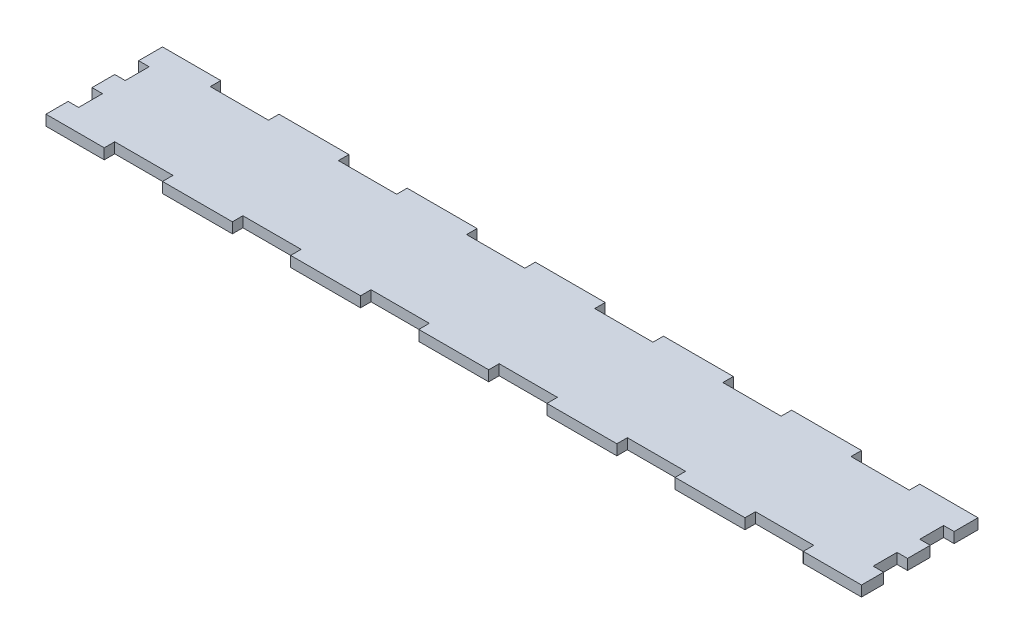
ISO-10303-21;
HEADER;
FILE_DESCRIPTION(('STEP AP214'),'2;1');
FILE_NAME('part.step','',(''),(''),'','','');
FILE_SCHEMA(('AUTOMOTIVE_DESIGN { 1 0 10303 214 1 1 1 1 }'));
ENDSEC;
DATA;
#1=APPLICATION_CONTEXT('core data for automotive mechanical design processes');
#2=APPLICATION_PROTOCOL_DEFINITION('international standard','automotive_design',2000,#1);
#3=PRODUCT_CONTEXT('',#1,'mechanical');
#4=PRODUCT('Part','Part','',(#3));
#5=PRODUCT_RELATED_PRODUCT_CATEGORY('part','',(#4));
#6=PRODUCT_DEFINITION_FORMATION('','',#4);
#7=PRODUCT_DEFINITION_CONTEXT('part definition',#1,'design');
#8=PRODUCT_DEFINITION('design','',#6,#7);
#9=PRODUCT_DEFINITION_SHAPE('','',#8);
#10=(LENGTH_UNIT() NAMED_UNIT(*) SI_UNIT(.MILLI.,.METRE.));
#11=(NAMED_UNIT(*) PLANE_ANGLE_UNIT() SI_UNIT($,.RADIAN.));
#12=(NAMED_UNIT(*) SI_UNIT($,.STERADIAN.) SOLID_ANGLE_UNIT());
#13=UNCERTAINTY_MEASURE_WITH_UNIT(LENGTH_MEASURE(1.E-05),#10,'distance_accuracy_value','');
#14=(GEOMETRIC_REPRESENTATION_CONTEXT(3) GLOBAL_UNCERTAINTY_ASSIGNED_CONTEXT((#13)) GLOBAL_UNIT_ASSIGNED_CONTEXT((#10,
#11,#12)) REPRESENTATION_CONTEXT('',''));
#15=CARTESIAN_POINT('',(0.,0.,0.));
#16=DIRECTION('',(0.,0.,1.));
#17=DIRECTION('',(1.,0.,0.));
#18=AXIS2_PLACEMENT_3D('',#15,#16,#17);
#19=CARTESIAN_POINT('',(-350.,9.,-50.));
#20=DIRECTION('',(0.,0.,1.));
#21=DIRECTION('',(1.,0.,0.));
#22=AXIS2_PLACEMENT_3D('',#19,#20,#21);
#23=PLANE('',#22);
#24=DIRECTION('',(-1.,0.,0.));
#25=VECTOR('',#24,1.);
#26=CARTESIAN_POINT('',(-350.,0.,-50.));
#27=LINE('',#26,#25);
#28=CARTESIAN_POINT('',(350.,0.,-50.));
#29=VERTEX_POINT('',#28);
#30=CARTESIAN_POINT('',(300.,0.,-50.));
#31=VERTEX_POINT('',#30);
#32=EDGE_CURVE('E588',#29,#31,#27,.T.);
#33=ORIENTED_EDGE('',*,*,#32,.T.);
#34=DIRECTION('',(0.,1.,0.));
#35=VECTOR('',#34,1.);
#36=CARTESIAN_POINT('',(300.,0.,-50.));
#37=LINE('',#36,#35);
#38=CARTESIAN_POINT('',(300.,9.,-50.));
#39=VERTEX_POINT('',#38);
#40=EDGE_CURVE('E780',#31,#39,#37,.T.);
#41=ORIENTED_EDGE('',*,*,#40,.T.);
#42=DIRECTION('',(-1.,0.,0.));
#43=VECTOR('',#42,1.);
#44=CARTESIAN_POINT('',(-350.,9.,-50.));
#45=LINE('',#44,#43);
#46=CARTESIAN_POINT('',(350.,9.,-50.));
#47=VERTEX_POINT('',#46);
#48=EDGE_CURVE('E834',#47,#39,#45,.T.);
#49=ORIENTED_EDGE('',*,*,#48,.F.);
#50=DIRECTION('',(0.,-1.,0.));
#51=VECTOR('',#50,1.);
#52=CARTESIAN_POINT('',(350.,9.,-50.));
#53=LINE('',#52,#51);
#54=EDGE_CURVE('E536',#47,#29,#53,.T.);
#55=ORIENTED_EDGE('',*,*,#54,.T.);
#56=EDGE_LOOP('',(#33,#41,#49,#55));
#57=FACE_BOUND('',#56,.T.);
#58=ADVANCED_FACE('F37',(#57),#23,.F.);
#59=CARTESIAN_POINT('',(250.,9.,-50.));
#60=VERTEX_POINT('',#59);
#61=CARTESIAN_POINT('',(190.,9.,-50.));
#62=VERTEX_POINT('',#61);
#63=EDGE_CURVE('E838',#60,#62,#45,.T.);
#64=ORIENTED_EDGE('',*,*,#63,.F.);
#65=DIRECTION('',(0.,1.,0.));
#66=VECTOR('',#65,1.);
#67=CARTESIAN_POINT('',(250.,0.,-50.));
#68=LINE('',#67,#66);
#69=CARTESIAN_POINT('',(250.,0.,-50.));
#70=VERTEX_POINT('',#69);
#71=EDGE_CURVE('E992',#70,#60,#68,.T.);
#72=ORIENTED_EDGE('',*,*,#71,.F.);
#73=CARTESIAN_POINT('',(190.,0.,-50.));
#74=VERTEX_POINT('',#73);
#75=EDGE_CURVE('E592',#70,#74,#27,.T.);
#76=ORIENTED_EDGE('',*,*,#75,.T.);
#77=DIRECTION('',(0.,1.,0.));
#78=VECTOR('',#77,1.);
#79=CARTESIAN_POINT('',(190.,0.,-50.));
#80=LINE('',#79,#78);
#81=EDGE_CURVE('E754',#74,#62,#80,.T.);
#82=ORIENTED_EDGE('',*,*,#81,.T.);
#83=EDGE_LOOP('',(#64,#72,#76,#82));
#84=FACE_BOUND('',#83,.T.);
#85=ADVANCED_FACE('F926',(#84),#23,.F.);
#86=CARTESIAN_POINT('',(140.,9.,-50.));
#87=VERTEX_POINT('',#86);
#88=CARTESIAN_POINT('',(80.0000000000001,9.,-50.));
#89=VERTEX_POINT('',#88);
#90=EDGE_CURVE('E975',#87,#89,#45,.T.);
#91=ORIENTED_EDGE('',*,*,#90,.F.);
#92=DIRECTION('',(0.,1.,0.));
#93=VECTOR('',#92,1.);
#94=CARTESIAN_POINT('',(140.,0.,-50.));
#95=LINE('',#94,#93);
#96=CARTESIAN_POINT('',(140.,0.,-50.));
#97=VERTEX_POINT('',#96);
#98=EDGE_CURVE('E775',#97,#87,#95,.T.);
#99=ORIENTED_EDGE('',*,*,#98,.F.);
#100=CARTESIAN_POINT('',(80.0000000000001,0.,-50.));
#101=VERTEX_POINT('',#100);
#102=EDGE_CURVE('E1007',#97,#101,#27,.T.);
#103=ORIENTED_EDGE('',*,*,#102,.T.);
#104=DIRECTION('',(0.,1.,0.));
#105=VECTOR('',#104,1.);
#106=CARTESIAN_POINT('',(80.0000000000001,0.,-50.));
#107=LINE('',#106,#105);
#108=EDGE_CURVE('E728',#101,#89,#107,.T.);
#109=ORIENTED_EDGE('',*,*,#108,.T.);
#110=EDGE_LOOP('',(#91,#99,#103,#109));
#111=FACE_BOUND('',#110,.T.);
#112=ADVANCED_FACE('F933',(#111),#23,.F.);
#113=CARTESIAN_POINT('',(30.0000000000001,9.,-50.));
#114=VERTEX_POINT('',#113);
#115=CARTESIAN_POINT('',(-29.9999999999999,9.,-50.));
#116=VERTEX_POINT('',#115);
#117=EDGE_CURVE('E970',#114,#116,#45,.T.);
#118=ORIENTED_EDGE('',*,*,#117,.F.);
#119=DIRECTION('',(0.,1.,0.));
#120=VECTOR('',#119,1.);
#121=CARTESIAN_POINT('',(30.0000000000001,0.,-50.));
#122=LINE('',#121,#120);
#123=CARTESIAN_POINT('',(30.0000000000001,0.,-50.));
#124=VERTEX_POINT('',#123);
#125=EDGE_CURVE('E749',#124,#114,#122,.T.);
#126=ORIENTED_EDGE('',*,*,#125,.F.);
#127=CARTESIAN_POINT('',(-29.9999999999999,0.,-50.));
#128=VERTEX_POINT('',#127);
#129=EDGE_CURVE('E1021',#124,#128,#27,.T.);
#130=ORIENTED_EDGE('',*,*,#129,.T.);
#131=DIRECTION('',(0.,1.,0.));
#132=VECTOR('',#131,1.);
#133=CARTESIAN_POINT('',(-29.9999999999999,0.,-50.));
#134=LINE('',#133,#132);
#135=EDGE_CURVE('E700',#128,#116,#134,.T.);
#136=ORIENTED_EDGE('',*,*,#135,.T.);
#137=EDGE_LOOP('',(#118,#126,#130,#136));
#138=FACE_BOUND('',#137,.T.);
#139=ADVANCED_FACE('F956',(#138),#23,.F.);
#140=CARTESIAN_POINT('',(-79.9999999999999,9.,-50.));
#141=VERTEX_POINT('',#140);
#142=CARTESIAN_POINT('',(-140.,9.,-50.));
#143=VERTEX_POINT('',#142);
#144=EDGE_CURVE('E966',#141,#143,#45,.T.);
#145=ORIENTED_EDGE('',*,*,#144,.F.);
#146=DIRECTION('',(0.,1.,0.));
#147=VECTOR('',#146,1.);
#148=CARTESIAN_POINT('',(-79.9999999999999,0.,-50.));
#149=LINE('',#148,#147);
#150=CARTESIAN_POINT('',(-79.9999999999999,0.,-50.));
#151=VERTEX_POINT('',#150);
#152=EDGE_CURVE('E723',#151,#141,#149,.T.);
#153=ORIENTED_EDGE('',*,*,#152,.F.);
#154=CARTESIAN_POINT('',(-140.,0.,-50.));
#155=VERTEX_POINT('',#154);
#156=EDGE_CURVE('E1034',#151,#155,#27,.T.);
#157=ORIENTED_EDGE('',*,*,#156,.T.);
#158=DIRECTION('',(0.,1.,0.));
#159=VECTOR('',#158,1.);
#160=CARTESIAN_POINT('',(-140.,0.,-50.));
#161=LINE('',#160,#159);
#162=EDGE_CURVE('E704',#155,#143,#161,.T.);
#163=ORIENTED_EDGE('',*,*,#162,.T.);
#164=EDGE_LOOP('',(#145,#153,#157,#163));
#165=FACE_BOUND('',#164,.T.);
#166=ADVANCED_FACE('F951',(#165),#23,.F.);
#167=CARTESIAN_POINT('',(-300.,9.,-50.));
#168=VERTEX_POINT('',#167);
#169=CARTESIAN_POINT('',(-350.,9.,-50.));
#170=VERTEX_POINT('',#169);
#171=EDGE_CURVE('E833',#168,#170,#45,.T.);
#172=ORIENTED_EDGE('',*,*,#171,.F.);
#173=DIRECTION('',(0.,1.,0.));
#174=VECTOR('',#173,1.);
#175=CARTESIAN_POINT('',(-300.,0.,-50.));
#176=LINE('',#175,#174);
#177=CARTESIAN_POINT('',(-300.,0.,-50.));
#178=VERTEX_POINT('',#177);
#179=EDGE_CURVE('E808',#178,#168,#176,.T.);
#180=ORIENTED_EDGE('',*,*,#179,.F.);
#181=CARTESIAN_POINT('',(-350.,0.,-50.));
#182=VERTEX_POINT('',#181);
#183=EDGE_CURVE('E587',#178,#182,#27,.T.);
#184=ORIENTED_EDGE('',*,*,#183,.T.);
#185=DIRECTION('',(0.,-1.,0.));
#186=VECTOR('',#185,1.);
#187=CARTESIAN_POINT('',(-350.,9.,-50.));
#188=LINE('',#187,#186);
#189=EDGE_CURVE('E533',#170,#182,#188,.T.);
#190=ORIENTED_EDGE('',*,*,#189,.F.);
#191=EDGE_LOOP('',(#172,#180,#184,#190));
#192=FACE_BOUND('',#191,.T.);
#193=ADVANCED_FACE('F920',(#192),#23,.F.);
#194=CARTESIAN_POINT('',(-350.,9.,50.));
#195=DIRECTION('',(0.,0.,-1.));
#196=DIRECTION('',(-1.,0.,0.));
#197=AXIS2_PLACEMENT_3D('',#194,#195,#196);
#198=PLANE('',#197);
#199=DIRECTION('',(1.,0.,0.));
#200=VECTOR('',#199,1.);
#201=CARTESIAN_POINT('',(-350.,0.,50.));
#202=LINE('',#201,#200);
#203=CARTESIAN_POINT('',(-29.9999999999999,0.,50.));
#204=VERTEX_POINT('',#203);
#205=CARTESIAN_POINT('',(30.0000000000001,0.,50.));
#206=VERTEX_POINT('',#205);
#207=EDGE_CURVE('E489',#204,#206,#202,.T.);
#208=ORIENTED_EDGE('',*,*,#207,.T.);
#209=DIRECTION('',(0.,1.,0.));
#210=VECTOR('',#209,1.);
#211=CARTESIAN_POINT('',(30.0000000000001,0.,50.));
#212=LINE('',#211,#210);
#213=CARTESIAN_POINT('',(30.0000000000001,9.,50.));
#214=VERTEX_POINT('',#213);
#215=EDGE_CURVE('E670',#206,#214,#212,.T.);
#216=ORIENTED_EDGE('',*,*,#215,.T.);
#217=DIRECTION('',(1.,0.,0.));
#218=VECTOR('',#217,1.);
#219=CARTESIAN_POINT('',(-350.,9.,50.));
#220=LINE('',#219,#218);
#221=CARTESIAN_POINT('',(-29.9999999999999,9.,50.));
#222=VERTEX_POINT('',#221);
#223=EDGE_CURVE('E903',#222,#214,#220,.T.);
#224=ORIENTED_EDGE('',*,*,#223,.F.);
#225=DIRECTION('',(0.,1.,0.));
#226=VECTOR('',#225,1.);
#227=CARTESIAN_POINT('',(-29.9999999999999,0.,50.));
#228=LINE('',#227,#226);
#229=EDGE_CURVE('E473',#204,#222,#228,.T.);
#230=ORIENTED_EDGE('',*,*,#229,.F.);
#231=EDGE_LOOP('',(#208,#216,#224,#230));
#232=FACE_BOUND('',#231,.T.);
#233=ADVANCED_FACE('F909',(#232),#198,.F.);
#234=CARTESIAN_POINT('',(80.0000000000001,9.,50.));
#235=VERTEX_POINT('',#234);
#236=CARTESIAN_POINT('',(140.,9.,50.));
#237=VERTEX_POINT('',#236);
#238=EDGE_CURVE('E902',#235,#237,#220,.T.);
#239=ORIENTED_EDGE('',*,*,#238,.F.);
#240=DIRECTION('',(0.,1.,0.));
#241=VECTOR('',#240,1.);
#242=CARTESIAN_POINT('',(80.0000000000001,0.,50.));
#243=LINE('',#242,#241);
#244=CARTESIAN_POINT('',(80.0000000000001,0.,50.));
#245=VERTEX_POINT('',#244);
#246=EDGE_CURVE('E631',#245,#235,#243,.T.);
#247=ORIENTED_EDGE('',*,*,#246,.F.);
#248=CARTESIAN_POINT('',(140.,0.,50.));
#249=VERTEX_POINT('',#248);
#250=EDGE_CURVE('E494',#245,#249,#202,.T.);
#251=ORIENTED_EDGE('',*,*,#250,.T.);
#252=DIRECTION('',(0.,1.,0.));
#253=VECTOR('',#252,1.);
#254=CARTESIAN_POINT('',(140.,0.,50.));
#255=LINE('',#254,#253);
#256=EDGE_CURVE('E629',#249,#237,#255,.T.);
#257=ORIENTED_EDGE('',*,*,#256,.T.);
#258=EDGE_LOOP('',(#239,#247,#251,#257));
#259=FACE_BOUND('',#258,.T.);
#260=ADVANCED_FACE('F628',(#259),#198,.F.);
#261=CARTESIAN_POINT('',(190.,9.,50.));
#262=VERTEX_POINT('',#261);
#263=CARTESIAN_POINT('',(250.,9.,50.));
#264=VERTEX_POINT('',#263);
#265=EDGE_CURVE('E892',#262,#264,#220,.T.);
#266=ORIENTED_EDGE('',*,*,#265,.F.);
#267=DIRECTION('',(0.,1.,0.));
#268=VECTOR('',#267,1.);
#269=CARTESIAN_POINT('',(190.,0.,50.));
#270=LINE('',#269,#268);
#271=CARTESIAN_POINT('',(190.,0.,50.));
#272=VERTEX_POINT('',#271);
#273=EDGE_CURVE('E661',#272,#262,#270,.T.);
#274=ORIENTED_EDGE('',*,*,#273,.F.);
#275=CARTESIAN_POINT('',(250.,0.,50.));
#276=VERTEX_POINT('',#275);
#277=EDGE_CURVE('E612',#272,#276,#202,.T.);
#278=ORIENTED_EDGE('',*,*,#277,.T.);
#279=DIRECTION('',(0.,1.,0.));
#280=VECTOR('',#279,1.);
#281=CARTESIAN_POINT('',(250.,0.,50.));
#282=LINE('',#281,#280);
#283=EDGE_CURVE('E647',#276,#264,#282,.T.);
#284=ORIENTED_EDGE('',*,*,#283,.T.);
#285=EDGE_LOOP('',(#266,#274,#278,#284));
#286=FACE_BOUND('',#285,.T.);
#287=ADVANCED_FACE('F891',(#286),#198,.F.);
#288=CARTESIAN_POINT('',(-140.,0.,50.));
#289=VERTEX_POINT('',#288);
#290=CARTESIAN_POINT('',(-79.9999999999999,0.,50.));
#291=VERTEX_POINT('',#290);
#292=EDGE_CURVE('E480',#289,#291,#202,.T.);
#293=ORIENTED_EDGE('',*,*,#292,.T.);
#294=DIRECTION('',(0.,1.,0.));
#295=VECTOR('',#294,1.);
#296=CARTESIAN_POINT('',(-79.9999999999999,0.,50.));
#297=LINE('',#296,#295);
#298=CARTESIAN_POINT('',(-79.9999999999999,9.,50.));
#299=VERTEX_POINT('',#298);
#300=EDGE_CURVE('E462',#291,#299,#297,.T.);
#301=ORIENTED_EDGE('',*,*,#300,.T.);
#302=CARTESIAN_POINT('',(-140.,9.,50.));
#303=VERTEX_POINT('',#302);
#304=EDGE_CURVE('E1178',#303,#299,#220,.T.);
#305=ORIENTED_EDGE('',*,*,#304,.F.);
#306=DIRECTION('',(0.,1.,0.));
#307=VECTOR('',#306,1.);
#308=CARTESIAN_POINT('',(-140.,0.,50.));
#309=LINE('',#308,#307);
#310=EDGE_CURVE('E487',#289,#303,#309,.T.);
#311=ORIENTED_EDGE('',*,*,#310,.F.);
#312=EDGE_LOOP('',(#293,#301,#305,#311));
#313=FACE_BOUND('',#312,.T.);
#314=ADVANCED_FACE('F486',(#313),#198,.F.);
#315=CARTESIAN_POINT('',(-250.,0.,50.));
#316=VERTEX_POINT('',#315);
#317=CARTESIAN_POINT('',(-190.,0.,50.));
#318=VERTEX_POINT('',#317);
#319=EDGE_CURVE('E488',#316,#318,#202,.T.);
#320=ORIENTED_EDGE('',*,*,#319,.T.);
#321=DIRECTION('',(0.,1.,0.));
#322=VECTOR('',#321,1.);
#323=CARTESIAN_POINT('',(-190.,0.,50.));
#324=LINE('',#323,#322);
#325=CARTESIAN_POINT('',(-190.,9.,50.));
#326=VERTEX_POINT('',#325);
#327=EDGE_CURVE('E1199',#318,#326,#324,.T.);
#328=ORIENTED_EDGE('',*,*,#327,.T.);
#329=CARTESIAN_POINT('',(-250.,9.,50.));
#330=VERTEX_POINT('',#329);
#331=EDGE_CURVE('E858',#330,#326,#220,.T.);
#332=ORIENTED_EDGE('',*,*,#331,.F.);
#333=DIRECTION('',(0.,1.,0.));
#334=VECTOR('',#333,1.);
#335=CARTESIAN_POINT('',(-250.,0.,50.));
#336=LINE('',#335,#334);
#337=EDGE_CURVE('E1233',#316,#330,#336,.T.);
#338=ORIENTED_EDGE('',*,*,#337,.F.);
#339=EDGE_LOOP('',(#320,#328,#332,#338));
#340=FACE_BOUND('',#339,.T.);
#341=ADVANCED_FACE('F923',(#340),#198,.F.);
#342=CARTESIAN_POINT('',(-350.,0.,50.));
#343=VERTEX_POINT('',#342);
#344=CARTESIAN_POINT('',(-300.,0.,50.));
#345=VERTEX_POINT('',#344);
#346=EDGE_CURVE('E492',#343,#345,#202,.T.);
#347=ORIENTED_EDGE('',*,*,#346,.T.);
#348=DIRECTION('',(0.,1.,0.));
#349=VECTOR('',#348,1.);
#350=CARTESIAN_POINT('',(-300.,0.,50.));
#351=LINE('',#350,#349);
#352=CARTESIAN_POINT('',(-300.,9.,50.));
#353=VERTEX_POINT('',#352);
#354=EDGE_CURVE('E1222',#345,#353,#351,.T.);
#355=ORIENTED_EDGE('',*,*,#354,.T.);
#356=CARTESIAN_POINT('',(-350.,9.,50.));
#357=VERTEX_POINT('',#356);
#358=EDGE_CURVE('E506',#357,#353,#220,.T.);
#359=ORIENTED_EDGE('',*,*,#358,.F.);
#360=DIRECTION('',(0.,-1.,0.));
#361=VECTOR('',#360,1.);
#362=CARTESIAN_POINT('',(-350.,9.,50.));
#363=LINE('',#362,#361);
#364=EDGE_CURVE('E505',#357,#343,#363,.T.);
#365=ORIENTED_EDGE('',*,*,#364,.T.);
#366=EDGE_LOOP('',(#347,#355,#359,#365));
#367=FACE_BOUND('',#366,.T.);
#368=ADVANCED_FACE('F910',(#367),#198,.F.);
#369=CARTESIAN_POINT('',(349.999999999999,9.,31.));
#370=DIRECTION('',(-1.,0.,0.));
#371=DIRECTION('',(0.,0.,1.));
#372=AXIS2_PLACEMENT_3D('',#369,#370,#371);
#373=PLANE('',#372);
#374=DIRECTION('',(0.,0.,-1.));
#375=VECTOR('',#374,1.);
#376=CARTESIAN_POINT('',(349.999999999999,0.,31.));
#377=LINE('',#376,#375);
#378=CARTESIAN_POINT('',(350.,0.,50.));
#379=VERTEX_POINT('',#378);
#380=CARTESIAN_POINT('',(349.999999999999,0.,31.));
#381=VERTEX_POINT('',#380);
#382=EDGE_CURVE('E574',#379,#381,#377,.T.);
#383=ORIENTED_EDGE('',*,*,#382,.T.);
#384=DIRECTION('',(0.,-1.,0.));
#385=VECTOR('',#384,1.);
#386=CARTESIAN_POINT('',(349.999999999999,9.,31.));
#387=LINE('',#386,#385);
#388=CARTESIAN_POINT('',(349.999999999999,9.,31.));
#389=VERTEX_POINT('',#388);
#390=EDGE_CURVE('E11',#389,#381,#387,.T.);
#391=ORIENTED_EDGE('',*,*,#390,.F.);
#392=DIRECTION('',(0.,0.,-1.));
#393=VECTOR('',#392,1.);
#394=CARTESIAN_POINT('',(349.999999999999,9.,31.));
#395=LINE('',#394,#393);
#396=CARTESIAN_POINT('',(350.,9.,50.));
#397=VERTEX_POINT('',#396);
#398=EDGE_CURVE('E498',#397,#389,#395,.T.);
#399=ORIENTED_EDGE('',*,*,#398,.F.);
#400=DIRECTION('',(0.,-1.,0.));
#401=VECTOR('',#400,1.);
#402=CARTESIAN_POINT('',(350.,9.,50.));
#403=LINE('',#402,#401);
#404=EDGE_CURVE('E502',#397,#379,#403,.T.);
#405=ORIENTED_EDGE('',*,*,#404,.T.);
#406=EDGE_LOOP('',(#383,#391,#399,#405));
#407=FACE_BOUND('',#406,.T.);
#408=ADVANCED_FACE('F39',(#407),#373,.F.);
#409=CARTESIAN_POINT('',(349.999999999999,9.,31.));
#410=DIRECTION('',(0.,0.,1.));
#411=DIRECTION('',(1.,0.,0.));
#412=AXIS2_PLACEMENT_3D('',#409,#410,#411);
#413=PLANE('',#412);
#414=DIRECTION('',(-1.,0.,0.));
#415=VECTOR('',#414,1.);
#416=CARTESIAN_POINT('',(349.999999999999,0.,31.));
#417=LINE('',#416,#415);
#418=CARTESIAN_POINT('',(341.,0.,30.9999999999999));
#419=VERTEX_POINT('',#418);
#420=EDGE_CURVE('E568',#381,#419,#417,.T.);
#421=ORIENTED_EDGE('',*,*,#420,.T.);
#422=DIRECTION('',(0.,-1.,0.));
#423=VECTOR('',#422,1.);
#424=CARTESIAN_POINT('',(341.,9.,30.9999999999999));
#425=LINE('',#424,#423);
#426=CARTESIAN_POINT('',(341.,9.,30.9999999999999));
#427=VERTEX_POINT('',#426);
#428=EDGE_CURVE('E45',#427,#419,#425,.T.);
#429=ORIENTED_EDGE('',*,*,#428,.F.);
#430=DIRECTION('',(-1.,0.,0.));
#431=VECTOR('',#430,1.);
#432=CARTESIAN_POINT('',(349.999999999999,9.,31.));
#433=LINE('',#432,#431);
#434=EDGE_CURVE('E818',#389,#427,#433,.T.);
#435=ORIENTED_EDGE('',*,*,#434,.F.);
#436=ORIENTED_EDGE('',*,*,#390,.T.);
#437=EDGE_LOOP('',(#421,#429,#435,#436));
#438=FACE_BOUND('',#437,.T.);
#439=ADVANCED_FACE('F1286',(#438),#413,.F.);
#440=CARTESIAN_POINT('',(341.,9.,10.4999999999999));
#441=DIRECTION('',(-1.,0.,0.));
#442=DIRECTION('',(0.,0.,1.));
#443=AXIS2_PLACEMENT_3D('',#440,#441,#442);
#444=PLANE('',#443);
#445=DIRECTION('',(0.,0.,-1.));
#446=VECTOR('',#445,1.);
#447=CARTESIAN_POINT('',(341.,0.,10.4999999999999));
#448=LINE('',#447,#446);
#449=CARTESIAN_POINT('',(341.,0.,10.4999999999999));
#450=VERTEX_POINT('',#449);
#451=EDGE_CURVE('E563',#419,#450,#448,.T.);
#452=ORIENTED_EDGE('',*,*,#451,.T.);
#453=DIRECTION('',(0.,-1.,0.));
#454=VECTOR('',#453,1.);
#455=CARTESIAN_POINT('',(341.,9.,10.4999999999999));
#456=LINE('',#455,#454);
#457=CARTESIAN_POINT('',(341.,9.,10.4999999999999));
#458=VERTEX_POINT('',#457);
#459=EDGE_CURVE('E554',#458,#450,#456,.T.);
#460=ORIENTED_EDGE('',*,*,#459,.F.);
#461=DIRECTION('',(0.,0.,-1.));
#462=VECTOR('',#461,1.);
#463=CARTESIAN_POINT('',(341.,9.,10.4999999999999));
#464=LINE('',#463,#462);
#465=EDGE_CURVE('E564',#427,#458,#464,.T.);
#466=ORIENTED_EDGE('',*,*,#465,.F.);
#467=ORIENTED_EDGE('',*,*,#428,.T.);
#468=EDGE_LOOP('',(#452,#460,#466,#467));
#469=FACE_BOUND('',#468,.T.);
#470=ADVANCED_FACE('F561',(#469),#444,.F.);
#471=CARTESIAN_POINT('',(349.999999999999,9.,10.5));
#472=DIRECTION('',(0.,0.,-1.));
#473=DIRECTION('',(-1.,0.,0.));
#474=AXIS2_PLACEMENT_3D('',#471,#472,#473);
#475=PLANE('',#474);
#476=DIRECTION('',(1.,0.,0.));
#477=VECTOR('',#476,1.);
#478=CARTESIAN_POINT('',(349.999999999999,0.,10.5));
#479=LINE('',#478,#477);
#480=CARTESIAN_POINT('',(349.999999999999,0.,10.5));
#481=VERTEX_POINT('',#480);
#482=EDGE_CURVE('E570',#450,#481,#479,.T.);
#483=ORIENTED_EDGE('',*,*,#482,.T.);
#484=DIRECTION('',(0.,-1.,0.));
#485=VECTOR('',#484,1.);
#486=CARTESIAN_POINT('',(349.999999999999,9.,10.5));
#487=LINE('',#486,#485);
#488=CARTESIAN_POINT('',(349.999999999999,9.,10.5));
#489=VERTEX_POINT('',#488);
#490=EDGE_CURVE('E551',#489,#481,#487,.T.);
#491=ORIENTED_EDGE('',*,*,#490,.F.);
#492=DIRECTION('',(1.,0.,0.));
#493=VECTOR('',#492,1.);
#494=CARTESIAN_POINT('',(349.999999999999,9.,10.5));
#495=LINE('',#494,#493);
#496=EDGE_CURVE('E821',#458,#489,#495,.T.);
#497=ORIENTED_EDGE('',*,*,#496,.F.);
#498=ORIENTED_EDGE('',*,*,#459,.T.);
#499=EDGE_LOOP('',(#483,#491,#497,#498));
#500=FACE_BOUND('',#499,.T.);
#501=ADVANCED_FACE('F1285',(#500),#475,.F.);
#502=CARTESIAN_POINT('',(350.,9.,-9.00000000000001));
#503=DIRECTION('',(-1.,0.,0.));
#504=DIRECTION('',(0.,0.,1.));
#505=AXIS2_PLACEMENT_3D('',#502,#503,#504);
#506=PLANE('',#505);
#507=DIRECTION('',(0.,0.,-1.));
#508=VECTOR('',#507,1.);
#509=CARTESIAN_POINT('',(350.,0.,-9.00000000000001));
#510=LINE('',#509,#508);
#511=CARTESIAN_POINT('',(350.,0.,-9.00000000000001));
#512=VERTEX_POINT('',#511);
#513=EDGE_CURVE('E572',#481,#512,#510,.T.);
#514=ORIENTED_EDGE('',*,*,#513,.T.);
#515=DIRECTION('',(0.,-1.,0.));
#516=VECTOR('',#515,1.);
#517=CARTESIAN_POINT('',(350.,9.,-9.00000000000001));
#518=LINE('',#517,#516);
#519=CARTESIAN_POINT('',(350.,9.,-9.00000000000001));
#520=VERTEX_POINT('',#519);
#521=EDGE_CURVE('E548',#520,#512,#518,.T.);
#522=ORIENTED_EDGE('',*,*,#521,.F.);
#523=DIRECTION('',(0.,0.,-1.));
#524=VECTOR('',#523,1.);
#525=CARTESIAN_POINT('',(350.,9.,-9.00000000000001));
#526=LINE('',#525,#524);
#527=EDGE_CURVE('E823',#489,#520,#526,.T.);
#528=ORIENTED_EDGE('',*,*,#527,.F.);
#529=ORIENTED_EDGE('',*,*,#490,.T.);
#530=EDGE_LOOP('',(#514,#522,#528,#529));
#531=FACE_BOUND('',#530,.T.);
#532=ADVANCED_FACE('F1280',(#531),#506,.F.);
#533=CARTESIAN_POINT('',(350.,9.,-9.00000000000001));
#534=DIRECTION('',(0.,0.,1.));
#535=DIRECTION('',(1.,0.,0.));
#536=AXIS2_PLACEMENT_3D('',#533,#534,#535);
#537=PLANE('',#536);
#538=DIRECTION('',(-1.,0.,0.));
#539=VECTOR('',#538,1.);
#540=CARTESIAN_POINT('',(350.,0.,-9.00000000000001));
#541=LINE('',#540,#539);
#542=CARTESIAN_POINT('',(341.,0.,-9.0000000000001));
#543=VERTEX_POINT('',#542);
#544=EDGE_CURVE('E579',#512,#543,#541,.T.);
#545=ORIENTED_EDGE('',*,*,#544,.T.);
#546=DIRECTION('',(0.,-1.,0.));
#547=VECTOR('',#546,1.);
#548=CARTESIAN_POINT('',(341.,9.,-9.0000000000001));
#549=LINE('',#548,#547);
#550=CARTESIAN_POINT('',(341.,9.,-9.0000000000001));
#551=VERTEX_POINT('',#550);
#552=EDGE_CURVE('E545',#551,#543,#549,.T.);
#553=ORIENTED_EDGE('',*,*,#552,.F.);
#554=DIRECTION('',(-1.,0.,0.));
#555=VECTOR('',#554,1.);
#556=CARTESIAN_POINT('',(350.,9.,-9.00000000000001));
#557=LINE('',#556,#555);
#558=EDGE_CURVE('E825',#520,#551,#557,.T.);
#559=ORIENTED_EDGE('',*,*,#558,.F.);
#560=ORIENTED_EDGE('',*,*,#521,.T.);
#561=EDGE_LOOP('',(#545,#553,#559,#560));
#562=FACE_BOUND('',#561,.T.);
#563=ADVANCED_FACE('F1277',(#562),#537,.F.);
#564=CARTESIAN_POINT('',(341.,9.,-29.5000000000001));
#565=DIRECTION('',(-1.,0.,0.));
#566=DIRECTION('',(0.,0.,1.));
#567=AXIS2_PLACEMENT_3D('',#564,#565,#566);
#568=PLANE('',#567);
#569=DIRECTION('',(0.,0.,-1.));
#570=VECTOR('',#569,1.);
#571=CARTESIAN_POINT('',(341.,0.,-29.5000000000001));
#572=LINE('',#571,#570);
#573=CARTESIAN_POINT('',(341.,0.,-29.5000000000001));
#574=VERTEX_POINT('',#573);
#575=EDGE_CURVE('E581',#543,#574,#572,.T.);
#576=ORIENTED_EDGE('',*,*,#575,.T.);
#577=DIRECTION('',(0.,-1.,0.));
#578=VECTOR('',#577,1.);
#579=CARTESIAN_POINT('',(341.,9.,-29.5000000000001));
#580=LINE('',#579,#578);
#581=CARTESIAN_POINT('',(341.,9.,-29.5000000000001));
#582=VERTEX_POINT('',#581);
#583=EDGE_CURVE('E542',#582,#574,#580,.T.);
#584=ORIENTED_EDGE('',*,*,#583,.F.);
#585=DIRECTION('',(0.,0.,-1.));
#586=VECTOR('',#585,1.);
#587=CARTESIAN_POINT('',(341.,9.,-29.5000000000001));
#588=LINE('',#587,#586);
#589=EDGE_CURVE('E827',#551,#582,#588,.T.);
#590=ORIENTED_EDGE('',*,*,#589,.F.);
#591=ORIENTED_EDGE('',*,*,#552,.T.);
#592=EDGE_LOOP('',(#576,#584,#590,#591));
#593=FACE_BOUND('',#592,.T.);
#594=ADVANCED_FACE('F1273',(#593),#568,.F.);
#595=CARTESIAN_POINT('',(350.,9.,-29.5));
#596=DIRECTION('',(0.,0.,-1.));
#597=DIRECTION('',(-1.,0.,0.));
#598=AXIS2_PLACEMENT_3D('',#595,#596,#597);
#599=PLANE('',#598);
#600=DIRECTION('',(1.,0.,0.));
#601=VECTOR('',#600,1.);
#602=CARTESIAN_POINT('',(350.,0.,-29.5));
#603=LINE('',#602,#601);
#604=CARTESIAN_POINT('',(350.,0.,-29.5));
#605=VERTEX_POINT('',#604);
#606=EDGE_CURVE('E583',#574,#605,#603,.T.);
#607=ORIENTED_EDGE('',*,*,#606,.T.);
#608=DIRECTION('',(0.,-1.,0.));
#609=VECTOR('',#608,1.);
#610=CARTESIAN_POINT('',(350.,9.,-29.5));
#611=LINE('',#610,#609);
#612=CARTESIAN_POINT('',(350.,9.,-29.5));
#613=VERTEX_POINT('',#612);
#614=EDGE_CURVE('E539',#613,#605,#611,.T.);
#615=ORIENTED_EDGE('',*,*,#614,.F.);
#616=DIRECTION('',(1.,0.,0.));
#617=VECTOR('',#616,1.);
#618=CARTESIAN_POINT('',(350.,9.,-29.5));
#619=LINE('',#618,#617);
#620=EDGE_CURVE('E829',#582,#613,#619,.T.);
#621=ORIENTED_EDGE('',*,*,#620,.F.);
#622=ORIENTED_EDGE('',*,*,#583,.T.);
#623=EDGE_LOOP('',(#607,#615,#621,#622));
#624=FACE_BOUND('',#623,.T.);
#625=ADVANCED_FACE('F947',(#624),#599,.F.);
#626=CARTESIAN_POINT('',(350.,9.,-50.));
#627=DIRECTION('',(-1.,0.,0.));
#628=DIRECTION('',(0.,0.,1.));
#629=AXIS2_PLACEMENT_3D('',#626,#627,#628);
#630=PLANE('',#629);
#631=DIRECTION('',(0.,0.,-1.));
#632=VECTOR('',#631,1.);
#633=CARTESIAN_POINT('',(350.,0.,-50.));
#634=LINE('',#633,#632);
#635=EDGE_CURVE('E585',#605,#29,#634,.T.);
#636=ORIENTED_EDGE('',*,*,#635,.T.);
#637=ORIENTED_EDGE('',*,*,#54,.F.);
#638=DIRECTION('',(0.,0.,-1.));
#639=VECTOR('',#638,1.);
#640=CARTESIAN_POINT('',(350.,9.,-50.));
#641=LINE('',#640,#639);
#642=EDGE_CURVE('E831',#613,#47,#641,.T.);
#643=ORIENTED_EDGE('',*,*,#642,.F.);
#644=ORIENTED_EDGE('',*,*,#614,.T.);
#645=EDGE_LOOP('',(#636,#637,#643,#644));
#646=FACE_BOUND('',#645,.T.);
#647=ADVANCED_FACE('F939',(#646),#630,.F.);
#648=CARTESIAN_POINT('',(-190.,9.,-50.));
#649=VERTEX_POINT('',#648);
#650=CARTESIAN_POINT('',(-250.,9.,-50.));
#651=VERTEX_POINT('',#650);
#652=EDGE_CURVE('E964',#649,#651,#45,.T.);
#653=ORIENTED_EDGE('',*,*,#652,.F.);
#654=DIRECTION('',(0.,1.,0.));
#655=VECTOR('',#654,1.);
#656=CARTESIAN_POINT('',(-190.,0.,-50.));
#657=LINE('',#656,#655);
#658=CARTESIAN_POINT('',(-190.,0.,-50.));
#659=VERTEX_POINT('',#658);
#660=EDGE_CURVE('E695',#659,#649,#657,.T.);
#661=ORIENTED_EDGE('',*,*,#660,.F.);
#662=CARTESIAN_POINT('',(-250.,0.,-50.));
#663=VERTEX_POINT('',#662);
#664=EDGE_CURVE('E1047',#659,#663,#27,.T.);
#665=ORIENTED_EDGE('',*,*,#664,.T.);
#666=DIRECTION('',(0.,1.,0.));
#667=VECTOR('',#666,1.);
#668=CARTESIAN_POINT('',(-250.,0.,-50.));
#669=LINE('',#668,#667);
#670=EDGE_CURVE('E810',#663,#651,#669,.T.);
#671=ORIENTED_EDGE('',*,*,#670,.T.);
#672=EDGE_LOOP('',(#653,#661,#665,#671));
#673=FACE_BOUND('',#672,.T.);
#674=ADVANCED_FACE('F929',(#673),#23,.F.);
#675=CARTESIAN_POINT('',(-350.,9.,-50.));
#676=DIRECTION('',(1.,0.,0.));
#677=DIRECTION('',(0.,0.,-1.));
#678=AXIS2_PLACEMENT_3D('',#675,#676,#677);
#679=PLANE('',#678);
#680=DIRECTION('',(0.,0.,1.));
#681=VECTOR('',#680,1.);
#682=CARTESIAN_POINT('',(-350.,0.,-50.));
#683=LINE('',#682,#681);
#684=CARTESIAN_POINT('',(-350.,0.,-29.5));
#685=VERTEX_POINT('',#684);
#686=EDGE_CURVE('E591',#182,#685,#683,.T.);
#687=ORIENTED_EDGE('',*,*,#686,.T.);
#688=DIRECTION('',(0.,-1.,0.));
#689=VECTOR('',#688,1.);
#690=CARTESIAN_POINT('',(-350.,9.,-29.5));
#691=LINE('',#690,#689);
#692=CARTESIAN_POINT('',(-350.,9.,-29.5));
#693=VERTEX_POINT('',#692);
#694=EDGE_CURVE('E530',#693,#685,#691,.T.);
#695=ORIENTED_EDGE('',*,*,#694,.F.);
#696=DIRECTION('',(0.,0.,1.));
#697=VECTOR('',#696,1.);
#698=CARTESIAN_POINT('',(-350.,9.,-50.));
#699=LINE('',#698,#697);
#700=EDGE_CURVE('E837',#170,#693,#699,.T.);
#701=ORIENTED_EDGE('',*,*,#700,.F.);
#702=ORIENTED_EDGE('',*,*,#189,.T.);
#703=EDGE_LOOP('',(#687,#695,#701,#702));
#704=FACE_BOUND('',#703,.T.);
#705=ADVANCED_FACE('F938',(#704),#679,.F.);
#706=CARTESIAN_POINT('',(-350.,9.,-29.5));
#707=DIRECTION('',(0.,0.,-1.));
#708=DIRECTION('',(-1.,0.,0.));
#709=AXIS2_PLACEMENT_3D('',#706,#707,#708);
#710=PLANE('',#709);
#711=DIRECTION('',(1.,0.,0.));
#712=VECTOR('',#711,1.);
#713=CARTESIAN_POINT('',(-350.,0.,-29.5));
#714=LINE('',#713,#712);
#715=CARTESIAN_POINT('',(-341.,0.,-29.5));
#716=VERTEX_POINT('',#715);
#717=EDGE_CURVE('E594',#685,#716,#714,.T.);
#718=ORIENTED_EDGE('',*,*,#717,.T.);
#719=DIRECTION('',(0.,-1.,0.));
#720=VECTOR('',#719,1.);
#721=CARTESIAN_POINT('',(-341.,9.,-29.5));
#722=LINE('',#721,#720);
#723=CARTESIAN_POINT('',(-341.,9.,-29.5));
#724=VERTEX_POINT('',#723);
#725=EDGE_CURVE('E527',#724,#716,#722,.T.);
#726=ORIENTED_EDGE('',*,*,#725,.F.);
#727=DIRECTION('',(1.,0.,0.));
#728=VECTOR('',#727,1.);
#729=CARTESIAN_POINT('',(-350.,9.,-29.5));
#730=LINE('',#729,#728);
#731=EDGE_CURVE('E840',#693,#724,#730,.T.);
#732=ORIENTED_EDGE('',*,*,#731,.F.);
#733=ORIENTED_EDGE('',*,*,#694,.T.);
#734=EDGE_LOOP('',(#718,#726,#732,#733));
#735=FACE_BOUND('',#734,.T.);
#736=ADVANCED_FACE('F945',(#735),#710,.F.);
#737=CARTESIAN_POINT('',(-341.,9.,-29.5));
#738=DIRECTION('',(1.,0.,0.));
#739=DIRECTION('',(0.,0.,-1.));
#740=AXIS2_PLACEMENT_3D('',#737,#738,#739);
#741=PLANE('',#740);
#742=DIRECTION('',(0.,0.,1.));
#743=VECTOR('',#742,1.);
#744=CARTESIAN_POINT('',(-341.,0.,-29.5));
#745=LINE('',#744,#743);
#746=CARTESIAN_POINT('',(-341.,0.,-9.00000000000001));
#747=VERTEX_POINT('',#746);
#748=EDGE_CURVE('E596',#716,#747,#745,.T.);
#749=ORIENTED_EDGE('',*,*,#748,.T.);
#750=DIRECTION('',(0.,-1.,0.));
#751=VECTOR('',#750,1.);
#752=CARTESIAN_POINT('',(-341.,9.,-9.00000000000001));
#753=LINE('',#752,#751);
#754=CARTESIAN_POINT('',(-341.,9.,-9.00000000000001));
#755=VERTEX_POINT('',#754);
#756=EDGE_CURVE('E524',#755,#747,#753,.T.);
#757=ORIENTED_EDGE('',*,*,#756,.F.);
#758=DIRECTION('',(0.,0.,1.));
#759=VECTOR('',#758,1.);
#760=CARTESIAN_POINT('',(-341.,9.,-29.5));
#761=LINE('',#760,#759);
#762=EDGE_CURVE('E842',#724,#755,#761,.T.);
#763=ORIENTED_EDGE('',*,*,#762,.F.);
#764=ORIENTED_EDGE('',*,*,#725,.T.);
#765=EDGE_LOOP('',(#749,#757,#763,#764));
#766=FACE_BOUND('',#765,.T.);
#767=ADVANCED_FACE('F1327',(#766),#741,.F.);
#768=CARTESIAN_POINT('',(-350.,9.,-9.00000000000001));
#769=DIRECTION('',(0.,0.,1.));
#770=DIRECTION('',(1.,0.,0.));
#771=AXIS2_PLACEMENT_3D('',#768,#769,#770);
#772=PLANE('',#771);
#773=DIRECTION('',(-1.,0.,0.));
#774=VECTOR('',#773,1.);
#775=CARTESIAN_POINT('',(-350.,0.,-9.00000000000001));
#776=LINE('',#775,#774);
#777=CARTESIAN_POINT('',(-350.,0.,-9.00000000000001));
#778=VERTEX_POINT('',#777);
#779=EDGE_CURVE('E598',#747,#778,#776,.T.);
#780=ORIENTED_EDGE('',*,*,#779,.T.);
#781=DIRECTION('',(0.,-1.,0.));
#782=VECTOR('',#781,1.);
#783=CARTESIAN_POINT('',(-350.,9.,-9.00000000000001));
#784=LINE('',#783,#782);
#785=CARTESIAN_POINT('',(-350.,9.,-9.00000000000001));
#786=VERTEX_POINT('',#785);
#787=EDGE_CURVE('E521',#786,#778,#784,.T.);
#788=ORIENTED_EDGE('',*,*,#787,.F.);
#789=DIRECTION('',(-1.,0.,0.));
#790=VECTOR('',#789,1.);
#791=CARTESIAN_POINT('',(-350.,9.,-9.00000000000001));
#792=LINE('',#791,#790);
#793=EDGE_CURVE('E844',#755,#786,#792,.T.);
#794=ORIENTED_EDGE('',*,*,#793,.F.);
#795=ORIENTED_EDGE('',*,*,#756,.T.);
#796=EDGE_LOOP('',(#780,#788,#794,#795));
#797=FACE_BOUND('',#796,.T.);
#798=ADVANCED_FACE('F1337',(#797),#772,.F.);
#799=CARTESIAN_POINT('',(-350.,9.,-9.00000000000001));
#800=DIRECTION('',(1.,0.,0.));
#801=DIRECTION('',(0.,0.,-1.));
#802=AXIS2_PLACEMENT_3D('',#799,#800,#801);
#803=PLANE('',#802);
#804=DIRECTION('',(0.,0.,1.));
#805=VECTOR('',#804,1.);
#806=CARTESIAN_POINT('',(-350.,0.,-9.00000000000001));
#807=LINE('',#806,#805);
#808=CARTESIAN_POINT('',(-349.999999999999,0.,10.5));
#809=VERTEX_POINT('',#808);
#810=EDGE_CURVE('E600',#778,#809,#807,.T.);
#811=ORIENTED_EDGE('',*,*,#810,.T.);
#812=DIRECTION('',(0.,-1.,0.));
#813=VECTOR('',#812,1.);
#814=CARTESIAN_POINT('',(-349.999999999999,9.,10.5));
#815=LINE('',#814,#813);
#816=CARTESIAN_POINT('',(-349.999999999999,9.,10.5));
#817=VERTEX_POINT('',#816);
#818=EDGE_CURVE('E518',#817,#809,#815,.T.);
#819=ORIENTED_EDGE('',*,*,#818,.F.);
#820=DIRECTION('',(0.,0.,1.));
#821=VECTOR('',#820,1.);
#822=CARTESIAN_POINT('',(-350.,9.,-9.00000000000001));
#823=LINE('',#822,#821);
#824=EDGE_CURVE('E846',#786,#817,#823,.T.);
#825=ORIENTED_EDGE('',*,*,#824,.F.);
#826=ORIENTED_EDGE('',*,*,#787,.T.);
#827=EDGE_LOOP('',(#811,#819,#825,#826));
#828=FACE_BOUND('',#827,.T.);
#829=ADVANCED_FACE('F1347',(#828),#803,.F.);
#830=CARTESIAN_POINT('',(-349.999999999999,9.,10.5));
#831=DIRECTION('',(0.,0.,-1.));
#832=DIRECTION('',(-1.,0.,0.));
#833=AXIS2_PLACEMENT_3D('',#830,#831,#832);
#834=PLANE('',#833);
#835=DIRECTION('',(1.,0.,0.));
#836=VECTOR('',#835,1.);
#837=CARTESIAN_POINT('',(-349.999999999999,0.,10.5));
#838=LINE('',#837,#836);
#839=CARTESIAN_POINT('',(-341.,0.,10.5));
#840=VERTEX_POINT('',#839);
#841=EDGE_CURVE('E602',#809,#840,#838,.T.);
#842=ORIENTED_EDGE('',*,*,#841,.T.);
#843=DIRECTION('',(0.,-1.,0.));
#844=VECTOR('',#843,1.);
#845=CARTESIAN_POINT('',(-341.,9.,10.5));
#846=LINE('',#845,#844);
#847=CARTESIAN_POINT('',(-341.,9.,10.5));
#848=VERTEX_POINT('',#847);
#849=EDGE_CURVE('E515',#848,#840,#846,.T.);
#850=ORIENTED_EDGE('',*,*,#849,.F.);
#851=DIRECTION('',(1.,0.,0.));
#852=VECTOR('',#851,1.);
#853=CARTESIAN_POINT('',(-349.999999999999,9.,10.5));
#854=LINE('',#853,#852);
#855=EDGE_CURVE('E848',#817,#848,#854,.T.);
#856=ORIENTED_EDGE('',*,*,#855,.F.);
#857=ORIENTED_EDGE('',*,*,#818,.T.);
#858=EDGE_LOOP('',(#842,#850,#856,#857));
#859=FACE_BOUND('',#858,.T.);
#860=ADVANCED_FACE('F1357',(#859),#834,.F.);
#861=CARTESIAN_POINT('',(-341.,9.,10.5));
#862=DIRECTION('',(1.,0.,0.));
#863=DIRECTION('',(0.,0.,-1.));
#864=AXIS2_PLACEMENT_3D('',#861,#862,#863);
#865=PLANE('',#864);
#866=DIRECTION('',(0.,0.,1.));
#867=VECTOR('',#866,1.);
#868=CARTESIAN_POINT('',(-341.,0.,10.5));
#869=LINE('',#868,#867);
#870=CARTESIAN_POINT('',(-341.,0.,31.));
#871=VERTEX_POINT('',#870);
#872=EDGE_CURVE('E604',#840,#871,#869,.T.);
#873=ORIENTED_EDGE('',*,*,#872,.T.);
#874=DIRECTION('',(0.,-1.,0.));
#875=VECTOR('',#874,1.);
#876=CARTESIAN_POINT('',(-341.,9.,31.));
#877=LINE('',#876,#875);
#878=CARTESIAN_POINT('',(-341.,9.,31.));
#879=VERTEX_POINT('',#878);
#880=EDGE_CURVE('E512',#879,#871,#877,.T.);
#881=ORIENTED_EDGE('',*,*,#880,.F.);
#882=DIRECTION('',(0.,0.,1.));
#883=VECTOR('',#882,1.);
#884=CARTESIAN_POINT('',(-341.,9.,10.5));
#885=LINE('',#884,#883);
#886=EDGE_CURVE('E850',#848,#879,#885,.T.);
#887=ORIENTED_EDGE('',*,*,#886,.F.);
#888=ORIENTED_EDGE('',*,*,#849,.T.);
#889=EDGE_LOOP('',(#873,#881,#887,#888));
#890=FACE_BOUND('',#889,.T.);
#891=ADVANCED_FACE('F1367',(#890),#865,.F.);
#892=CARTESIAN_POINT('',(-349.999999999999,9.,31.));
#893=DIRECTION('',(0.,0.,1.));
#894=DIRECTION('',(1.,0.,0.));
#895=AXIS2_PLACEMENT_3D('',#892,#893,#894);
#896=PLANE('',#895);
#897=DIRECTION('',(-1.,0.,0.));
#898=VECTOR('',#897,1.);
#899=CARTESIAN_POINT('',(-349.999999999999,0.,31.));
#900=LINE('',#899,#898);
#901=CARTESIAN_POINT('',(-349.999999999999,0.,31.));
#902=VERTEX_POINT('',#901);
#903=EDGE_CURVE('E605',#871,#902,#900,.T.);
#904=ORIENTED_EDGE('',*,*,#903,.T.);
#905=DIRECTION('',(0.,-1.,0.));
#906=VECTOR('',#905,1.);
#907=CARTESIAN_POINT('',(-349.999999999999,9.,31.));
#908=LINE('',#907,#906);
#909=CARTESIAN_POINT('',(-349.999999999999,9.,31.));
#910=VERTEX_POINT('',#909);
#911=EDGE_CURVE('E509',#910,#902,#908,.T.);
#912=ORIENTED_EDGE('',*,*,#911,.F.);
#913=DIRECTION('',(-1.,0.,0.));
#914=VECTOR('',#913,1.);
#915=CARTESIAN_POINT('',(-349.999999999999,9.,31.));
#916=LINE('',#915,#914);
#917=EDGE_CURVE('E852',#879,#910,#916,.T.);
#918=ORIENTED_EDGE('',*,*,#917,.F.);
#919=ORIENTED_EDGE('',*,*,#880,.T.);
#920=EDGE_LOOP('',(#904,#912,#918,#919));
#921=FACE_BOUND('',#920,.T.);
#922=ADVANCED_FACE('F916',(#921),#896,.F.);
#923=CARTESIAN_POINT('',(-349.999999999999,9.,31.));
#924=DIRECTION('',(1.,0.,0.));
#925=DIRECTION('',(0.,0.,-1.));
#926=AXIS2_PLACEMENT_3D('',#923,#924,#925);
#927=PLANE('',#926);
#928=DIRECTION('',(0.,0.,1.));
#929=VECTOR('',#928,1.);
#930=CARTESIAN_POINT('',(-349.999999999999,0.,31.));
#931=LINE('',#930,#929);
#932=EDGE_CURVE('E500',#902,#343,#931,.T.);
#933=ORIENTED_EDGE('',*,*,#932,.T.);
#934=ORIENTED_EDGE('',*,*,#364,.F.);
#935=DIRECTION('',(0.,0.,1.));
#936=VECTOR('',#935,1.);
#937=CARTESIAN_POINT('',(-349.999999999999,9.,31.));
#938=LINE('',#937,#936);
#939=EDGE_CURVE('E854',#910,#357,#938,.T.);
#940=ORIENTED_EDGE('',*,*,#939,.F.);
#941=ORIENTED_EDGE('',*,*,#911,.T.);
#942=EDGE_LOOP('',(#933,#934,#940,#941));
#943=FACE_BOUND('',#942,.T.);
#944=ADVANCED_FACE('F907',(#943),#927,.F.);
#945=CARTESIAN_POINT('',(300.,9.,50.));
#946=VERTEX_POINT('',#945);
#947=EDGE_CURVE('E856',#946,#397,#220,.T.);
#948=ORIENTED_EDGE('',*,*,#947,.F.);
#949=DIRECTION('',(0.,1.,0.));
#950=VECTOR('',#949,1.);
#951=CARTESIAN_POINT('',(300.,0.,50.));
#952=LINE('',#951,#950);
#953=CARTESIAN_POINT('',(300.,0.,50.));
#954=VERTEX_POINT('',#953);
#955=EDGE_CURVE('E887',#954,#946,#952,.T.);
#956=ORIENTED_EDGE('',*,*,#955,.F.);
#957=EDGE_CURVE('E499',#954,#379,#202,.T.);
#958=ORIENTED_EDGE('',*,*,#957,.T.);
#959=ORIENTED_EDGE('',*,*,#404,.F.);
#960=EDGE_LOOP('',(#948,#956,#958,#959));
#961=FACE_BOUND('',#960,.T.);
#962=ADVANCED_FACE('F905',(#961),#198,.F.);
#963=CARTESIAN_POINT('',(0.,9.,0.));
#964=DIRECTION('',(0.,1.,0.));
#965=DIRECTION('',(0.,0.,1.));
#966=AXIS2_PLACEMENT_3D('',#963,#964,#965);
#967=PLANE('',#966);
#968=DIRECTION('',(0.,0.,1.));
#969=VECTOR('',#968,1.);
#970=CARTESIAN_POINT('',(30.0000000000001,9.,50.));
#971=LINE('',#970,#969);
#972=CARTESIAN_POINT('',(30.,9.,41.));
#973=VERTEX_POINT('',#972);
#974=EDGE_CURVE('E671',#973,#214,#971,.T.);
#975=ORIENTED_EDGE('',*,*,#974,.F.);
#976=DIRECTION('',(-1.,0.,0.));
#977=VECTOR('',#976,1.);
#978=CARTESIAN_POINT('',(30.,9.,41.));
#979=LINE('',#978,#977);
#980=CARTESIAN_POINT('',(80.,9.,41.));
#981=VERTEX_POINT('',#980);
#982=EDGE_CURVE('E667',#981,#973,#979,.T.);
#983=ORIENTED_EDGE('',*,*,#982,.F.);
#984=DIRECTION('',(0.,0.,-1.));
#985=VECTOR('',#984,1.);
#986=CARTESIAN_POINT('',(80.0000000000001,9.,50.));
#987=LINE('',#986,#985);
#988=EDGE_CURVE('E673',#235,#981,#987,.T.);
#989=ORIENTED_EDGE('',*,*,#988,.F.);
#990=ORIENTED_EDGE('',*,*,#238,.T.);
#991=DIRECTION('',(0.,0.,1.));
#992=VECTOR('',#991,1.);
#993=CARTESIAN_POINT('',(140.,9.,50.));
#994=LINE('',#993,#992);
#995=CARTESIAN_POINT('',(140.,9.,41.));
#996=VERTEX_POINT('',#995);
#997=EDGE_CURVE('E651',#996,#237,#994,.T.);
#998=ORIENTED_EDGE('',*,*,#997,.F.);
#999=DIRECTION('',(-1.,0.,0.));
#1000=VECTOR('',#999,1.);
#1001=CARTESIAN_POINT('',(140.,9.,41.));
#1002=LINE('',#1001,#1000);
#1003=CARTESIAN_POINT('',(190.,9.,41.));
#1004=VERTEX_POINT('',#1003);
#1005=EDGE_CURVE('E640',#1004,#996,#1002,.T.);
#1006=ORIENTED_EDGE('',*,*,#1005,.F.);
#1007=DIRECTION('',(0.,0.,-1.));
#1008=VECTOR('',#1007,1.);
#1009=CARTESIAN_POINT('',(190.,9.,50.));
#1010=LINE('',#1009,#1008);
#1011=EDGE_CURVE('E644',#262,#1004,#1010,.T.);
#1012=ORIENTED_EDGE('',*,*,#1011,.F.);
#1013=ORIENTED_EDGE('',*,*,#265,.T.);
#1014=DIRECTION('',(0.,0.,1.));
#1015=VECTOR('',#1014,1.);
#1016=CARTESIAN_POINT('',(250.,9.,50.));
#1017=LINE('',#1016,#1015);
#1018=CARTESIAN_POINT('',(250.,9.,41.));
#1019=VERTEX_POINT('',#1018);
#1020=EDGE_CURVE('E658',#1019,#264,#1017,.T.);
#1021=ORIENTED_EDGE('',*,*,#1020,.F.);
#1022=DIRECTION('',(-1.,0.,0.));
#1023=VECTOR('',#1022,1.);
#1024=CARTESIAN_POINT('',(250.,9.,41.));
#1025=LINE('',#1024,#1023);
#1026=CARTESIAN_POINT('',(300.,9.,41.));
#1027=VERTEX_POINT('',#1026);
#1028=EDGE_CURVE('E873',#1027,#1019,#1025,.T.);
#1029=ORIENTED_EDGE('',*,*,#1028,.F.);
#1030=DIRECTION('',(0.,0.,-1.));
#1031=VECTOR('',#1030,1.);
#1032=CARTESIAN_POINT('',(300.,9.,50.));
#1033=LINE('',#1032,#1031);
#1034=EDGE_CURVE('E878',#946,#1027,#1033,.T.);
#1035=ORIENTED_EDGE('',*,*,#1034,.F.);
#1036=ORIENTED_EDGE('',*,*,#947,.T.);
#1037=ORIENTED_EDGE('',*,*,#398,.T.);
#1038=ORIENTED_EDGE('',*,*,#434,.T.);
#1039=ORIENTED_EDGE('',*,*,#465,.T.);
#1040=ORIENTED_EDGE('',*,*,#496,.T.);
#1041=ORIENTED_EDGE('',*,*,#527,.T.);
#1042=ORIENTED_EDGE('',*,*,#558,.T.);
#1043=ORIENTED_EDGE('',*,*,#589,.T.);
#1044=ORIENTED_EDGE('',*,*,#620,.T.);
#1045=ORIENTED_EDGE('',*,*,#642,.T.);
#1046=ORIENTED_EDGE('',*,*,#48,.T.);
#1047=DIRECTION('',(0.,0.,-1.));
#1048=VECTOR('',#1047,1.);
#1049=CARTESIAN_POINT('',(300.,9.,-50.));
#1050=LINE('',#1049,#1048);
#1051=CARTESIAN_POINT('',(300.,9.,-41.));
#1052=VERTEX_POINT('',#1051);
#1053=EDGE_CURVE('E1240',#1052,#39,#1050,.T.);
#1054=ORIENTED_EDGE('',*,*,#1053,.F.);
#1055=DIRECTION('',(1.,0.,0.));
#1056=VECTOR('',#1055,1.);
#1057=CARTESIAN_POINT('',(250.,9.,-41.));
#1058=LINE('',#1057,#1056);
#1059=CARTESIAN_POINT('',(250.,9.,-41.));
#1060=VERTEX_POINT('',#1059);
#1061=EDGE_CURVE('E1247',#1060,#1052,#1058,.T.);
#1062=ORIENTED_EDGE('',*,*,#1061,.F.);
#1063=DIRECTION('',(0.,0.,1.));
#1064=VECTOR('',#1063,1.);
#1065=CARTESIAN_POINT('',(250.,9.,-50.));
#1066=LINE('',#1065,#1064);
#1067=EDGE_CURVE('E885',#60,#1060,#1066,.T.);
#1068=ORIENTED_EDGE('',*,*,#1067,.F.);
#1069=ORIENTED_EDGE('',*,*,#63,.T.);
#1070=DIRECTION('',(0.,0.,-1.));
#1071=VECTOR('',#1070,1.);
#1072=CARTESIAN_POINT('',(190.,9.,-50.));
#1073=LINE('',#1072,#1071);
#1074=CARTESIAN_POINT('',(190.,9.,-41.));
#1075=VERTEX_POINT('',#1074);
#1076=EDGE_CURVE('E769',#1075,#62,#1073,.T.);
#1077=ORIENTED_EDGE('',*,*,#1076,.F.);
#1078=DIRECTION('',(1.,0.,0.));
#1079=VECTOR('',#1078,1.);
#1080=CARTESIAN_POINT('',(140.,9.,-41.));
#1081=LINE('',#1080,#1079);
#1082=CARTESIAN_POINT('',(140.,9.,-41.));
#1083=VERTEX_POINT('',#1082);
#1084=EDGE_CURVE('E779',#1083,#1075,#1081,.T.);
#1085=ORIENTED_EDGE('',*,*,#1084,.F.);
#1086=DIRECTION('',(0.,0.,1.));
#1087=VECTOR('',#1086,1.);
#1088=CARTESIAN_POINT('',(140.,9.,-50.));
#1089=LINE('',#1088,#1087);
#1090=EDGE_CURVE('E776',#87,#1083,#1089,.T.);
#1091=ORIENTED_EDGE('',*,*,#1090,.F.);
#1092=ORIENTED_EDGE('',*,*,#90,.T.);
#1093=DIRECTION('',(0.,0.,-1.));
#1094=VECTOR('',#1093,1.);
#1095=CARTESIAN_POINT('',(80.0000000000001,9.,-50.));
#1096=LINE('',#1095,#1094);
#1097=CARTESIAN_POINT('',(80.,9.,-41.));
#1098=VERTEX_POINT('',#1097);
#1099=EDGE_CURVE('E743',#1098,#89,#1096,.T.);
#1100=ORIENTED_EDGE('',*,*,#1099,.F.);
#1101=DIRECTION('',(1.,0.,0.));
#1102=VECTOR('',#1101,1.);
#1103=CARTESIAN_POINT('',(30.,9.,-41.));
#1104=LINE('',#1103,#1102);
#1105=CARTESIAN_POINT('',(30.,9.,-41.));
#1106=VERTEX_POINT('',#1105);
#1107=EDGE_CURVE('E753',#1106,#1098,#1104,.T.);
#1108=ORIENTED_EDGE('',*,*,#1107,.F.);
#1109=DIRECTION('',(0.,0.,1.));
#1110=VECTOR('',#1109,1.);
#1111=CARTESIAN_POINT('',(30.0000000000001,9.,-50.));
#1112=LINE('',#1111,#1110);
#1113=EDGE_CURVE('E750',#114,#1106,#1112,.T.);
#1114=ORIENTED_EDGE('',*,*,#1113,.F.);
#1115=ORIENTED_EDGE('',*,*,#117,.T.);
#1116=DIRECTION('',(0.,0.,-1.));
#1117=VECTOR('',#1116,1.);
#1118=CARTESIAN_POINT('',(-29.9999999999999,9.,-50.));
#1119=LINE('',#1118,#1117);
#1120=CARTESIAN_POINT('',(-30.,9.,-41.));
#1121=VERTEX_POINT('',#1120);
#1122=EDGE_CURVE('E717',#1121,#116,#1119,.T.);
#1123=ORIENTED_EDGE('',*,*,#1122,.F.);
#1124=DIRECTION('',(1.,0.,0.));
#1125=VECTOR('',#1124,1.);
#1126=CARTESIAN_POINT('',(-80.,9.,-41.));
#1127=LINE('',#1126,#1125);
#1128=CARTESIAN_POINT('',(-80.,9.,-41.));
#1129=VERTEX_POINT('',#1128);
#1130=EDGE_CURVE('E727',#1129,#1121,#1127,.T.);
#1131=ORIENTED_EDGE('',*,*,#1130,.F.);
#1132=DIRECTION('',(0.,0.,1.));
#1133=VECTOR('',#1132,1.);
#1134=CARTESIAN_POINT('',(-79.9999999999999,9.,-50.));
#1135=LINE('',#1134,#1133);
#1136=EDGE_CURVE('E724',#141,#1129,#1135,.T.);
#1137=ORIENTED_EDGE('',*,*,#1136,.F.);
#1138=ORIENTED_EDGE('',*,*,#144,.T.);
#1139=DIRECTION('',(0.,0.,-1.));
#1140=VECTOR('',#1139,1.);
#1141=CARTESIAN_POINT('',(-140.,9.,-50.));
#1142=LINE('',#1141,#1140);
#1143=CARTESIAN_POINT('',(-140.,9.,-41.));
#1144=VERTEX_POINT('',#1143);
#1145=EDGE_CURVE('E689',#1144,#143,#1142,.T.);
#1146=ORIENTED_EDGE('',*,*,#1145,.F.);
#1147=DIRECTION('',(1.,0.,0.));
#1148=VECTOR('',#1147,1.);
#1149=CARTESIAN_POINT('',(-190.,9.,-41.));
#1150=LINE('',#1149,#1148);
#1151=CARTESIAN_POINT('',(-190.,9.,-41.));
#1152=VERTEX_POINT('',#1151);
#1153=EDGE_CURVE('E699',#1152,#1144,#1150,.T.);
#1154=ORIENTED_EDGE('',*,*,#1153,.F.);
#1155=DIRECTION('',(0.,0.,1.));
#1156=VECTOR('',#1155,1.);
#1157=CARTESIAN_POINT('',(-190.,9.,-50.));
#1158=LINE('',#1157,#1156);
#1159=EDGE_CURVE('E696',#649,#1152,#1158,.T.);
#1160=ORIENTED_EDGE('',*,*,#1159,.F.);
#1161=ORIENTED_EDGE('',*,*,#652,.T.);
#1162=DIRECTION('',(0.,0.,-1.));
#1163=VECTOR('',#1162,1.);
#1164=CARTESIAN_POINT('',(-250.,9.,-50.));
#1165=LINE('',#1164,#1163);
#1166=CARTESIAN_POINT('',(-250.,9.,-41.));
#1167=VERTEX_POINT('',#1166);
#1168=EDGE_CURVE('E795',#1167,#651,#1165,.T.);
#1169=ORIENTED_EDGE('',*,*,#1168,.F.);
#1170=DIRECTION('',(1.,0.,0.));
#1171=VECTOR('',#1170,1.);
#1172=CARTESIAN_POINT('',(-300.,9.,-41.));
#1173=LINE('',#1172,#1171);
#1174=CARTESIAN_POINT('',(-300.,9.,-41.));
#1175=VERTEX_POINT('',#1174);
#1176=EDGE_CURVE('E804',#1175,#1167,#1173,.T.);
#1177=ORIENTED_EDGE('',*,*,#1176,.F.);
#1178=DIRECTION('',(0.,0.,1.));
#1179=VECTOR('',#1178,1.);
#1180=CARTESIAN_POINT('',(-300.,9.,-50.));
#1181=LINE('',#1180,#1179);
#1182=EDGE_CURVE('E707',#168,#1175,#1181,.T.);
#1183=ORIENTED_EDGE('',*,*,#1182,.F.);
#1184=ORIENTED_EDGE('',*,*,#171,.T.);
#1185=ORIENTED_EDGE('',*,*,#700,.T.);
#1186=ORIENTED_EDGE('',*,*,#731,.T.);
#1187=ORIENTED_EDGE('',*,*,#762,.T.);
#1188=ORIENTED_EDGE('',*,*,#793,.T.);
#1189=ORIENTED_EDGE('',*,*,#824,.T.);
#1190=ORIENTED_EDGE('',*,*,#855,.T.);
#1191=ORIENTED_EDGE('',*,*,#886,.T.);
#1192=ORIENTED_EDGE('',*,*,#917,.T.);
#1193=ORIENTED_EDGE('',*,*,#939,.T.);
#1194=ORIENTED_EDGE('',*,*,#358,.T.);
#1195=DIRECTION('',(0.,0.,1.));
#1196=VECTOR('',#1195,1.);
#1197=CARTESIAN_POINT('',(-300.,9.,50.));
#1198=LINE('',#1197,#1196);
#1199=CARTESIAN_POINT('',(-300.,9.,41.));
#1200=VERTEX_POINT('',#1199);
#1201=EDGE_CURVE('E1223',#1200,#353,#1198,.T.);
#1202=ORIENTED_EDGE('',*,*,#1201,.F.);
#1203=DIRECTION('',(-1.,0.,0.));
#1204=VECTOR('',#1203,1.);
#1205=CARTESIAN_POINT('',(-300.,9.,41.));
#1206=LINE('',#1205,#1204);
#1207=CARTESIAN_POINT('',(-250.,9.,41.));
#1208=VERTEX_POINT('',#1207);
#1209=EDGE_CURVE('E1216',#1208,#1200,#1206,.T.);
#1210=ORIENTED_EDGE('',*,*,#1209,.F.);
#1211=DIRECTION('',(0.,0.,-1.));
#1212=VECTOR('',#1211,1.);
#1213=CARTESIAN_POINT('',(-250.,9.,50.));
#1214=LINE('',#1213,#1212);
#1215=EDGE_CURVE('E1225',#330,#1208,#1214,.T.);
#1216=ORIENTED_EDGE('',*,*,#1215,.F.);
#1217=ORIENTED_EDGE('',*,*,#331,.T.);
#1218=DIRECTION('',(0.,0.,1.));
#1219=VECTOR('',#1218,1.);
#1220=CARTESIAN_POINT('',(-190.,9.,50.));
#1221=LINE('',#1220,#1219);
#1222=CARTESIAN_POINT('',(-190.,9.,41.));
#1223=VERTEX_POINT('',#1222);
#1224=EDGE_CURVE('E1200',#1223,#326,#1221,.T.);
#1225=ORIENTED_EDGE('',*,*,#1224,.F.);
#1226=DIRECTION('',(-1.,0.,0.));
#1227=VECTOR('',#1226,1.);
#1228=CARTESIAN_POINT('',(-190.,9.,41.));
#1229=LINE('',#1228,#1227);
#1230=CARTESIAN_POINT('',(-140.,9.,41.));
#1231=VERTEX_POINT('',#1230);
#1232=EDGE_CURVE('E1194',#1231,#1223,#1229,.T.);
#1233=ORIENTED_EDGE('',*,*,#1232,.F.);
#1234=DIRECTION('',(0.,0.,-1.));
#1235=VECTOR('',#1234,1.);
#1236=CARTESIAN_POINT('',(-140.,9.,50.));
#1237=LINE('',#1236,#1235);
#1238=EDGE_CURVE('E1202',#303,#1231,#1237,.T.);
#1239=ORIENTED_EDGE('',*,*,#1238,.F.);
#1240=ORIENTED_EDGE('',*,*,#304,.T.);
#1241=DIRECTION('',(0.,0.,1.));
#1242=VECTOR('',#1241,1.);
#1243=CARTESIAN_POINT('',(-79.9999999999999,9.,50.));
#1244=LINE('',#1243,#1242);
#1245=CARTESIAN_POINT('',(-80.,9.,41.));
#1246=VERTEX_POINT('',#1245);
#1247=EDGE_CURVE('E468',#1246,#299,#1244,.T.);
#1248=ORIENTED_EDGE('',*,*,#1247,.F.);
#1249=DIRECTION('',(-1.,0.,0.));
#1250=VECTOR('',#1249,1.);
#1251=CARTESIAN_POINT('',(-80.,9.,41.));
#1252=LINE('',#1251,#1250);
#1253=CARTESIAN_POINT('',(-30.,9.,41.));
#1254=VERTEX_POINT('',#1253);
#1255=EDGE_CURVE('E483',#1254,#1246,#1252,.T.);
#1256=ORIENTED_EDGE('',*,*,#1255,.F.);
#1257=DIRECTION('',(0.,0.,-1.));
#1258=VECTOR('',#1257,1.);
#1259=CARTESIAN_POINT('',(-29.9999999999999,9.,50.));
#1260=LINE('',#1259,#1258);
#1261=EDGE_CURVE('E1175',#222,#1254,#1260,.T.);
#1262=ORIENTED_EDGE('',*,*,#1261,.F.);
#1263=ORIENTED_EDGE('',*,*,#223,.T.);
#1264=EDGE_LOOP('',(#975,#983,#989,#990,#998,#1006,#1012,#1013,#1021,#1029,#1035,#1036,#1037,
#1038,#1039,#1040,#1041,#1042,#1043,#1044,#1045,#1046,#1054,#1062,#1068,#1069,#1077,#1085,#1091,
#1092,#1100,#1108,#1114,#1115,#1123,#1131,#1137,#1138,#1146,#1154,#1160,#1161,#1169,#1177,#1183,
#1184,#1185,#1186,#1187,#1188,#1189,#1190,#1191,#1192,#1193,#1194,#1202,#1210,#1216,#1217,#1225,
#1233,#1239,#1240,#1248,#1256,#1262,#1263));
#1265=FACE_BOUND('',#1264,.T.);
#1266=ADVANCED_FACE('F899',(#1265),#967,.T.);
#1267=CARTESIAN_POINT('',(0.,0.,0.));
#1268=DIRECTION('',(0.,1.,0.));
#1269=DIRECTION('',(0.,0.,1.));
#1270=AXIS2_PLACEMENT_3D('',#1267,#1268,#1269);
#1271=PLANE('',#1270);
#1272=DIRECTION('',(-1.,0.,0.));
#1273=VECTOR('',#1272,1.);
#1274=CARTESIAN_POINT('',(30.,0.,41.));
#1275=LINE('',#1274,#1273);
#1276=CARTESIAN_POINT('',(80.,0.,41.));
#1277=VERTEX_POINT('',#1276);
#1278=CARTESIAN_POINT('',(30.,0.,41.));
#1279=VERTEX_POINT('',#1278);
#1280=EDGE_CURVE('E52',#1277,#1279,#1275,.T.);
#1281=ORIENTED_EDGE('',*,*,#1280,.T.);
#1282=DIRECTION('',(0.,0.,1.));
#1283=VECTOR('',#1282,1.);
#1284=CARTESIAN_POINT('',(30.0000000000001,0.,50.));
#1285=LINE('',#1284,#1283);
#1286=EDGE_CURVE('E664',#1279,#206,#1285,.T.);
#1287=ORIENTED_EDGE('',*,*,#1286,.T.);
#1288=ORIENTED_EDGE('',*,*,#207,.F.);
#1289=DIRECTION('',(0.,0.,-1.));
#1290=VECTOR('',#1289,1.);
#1291=CARTESIAN_POINT('',(-29.9999999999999,0.,50.));
#1292=LINE('',#1291,#1290);
#1293=CARTESIAN_POINT('',(-30.,0.,41.));
#1294=VERTEX_POINT('',#1293);
#1295=EDGE_CURVE('E482',#204,#1294,#1292,.T.);
#1296=ORIENTED_EDGE('',*,*,#1295,.T.);
#1297=DIRECTION('',(-1.,0.,0.));
#1298=VECTOR('',#1297,1.);
#1299=CARTESIAN_POINT('',(-80.,0.,41.));
#1300=LINE('',#1299,#1298);
#1301=CARTESIAN_POINT('',(-80.,0.,41.));
#1302=VERTEX_POINT('',#1301);
#1303=EDGE_CURVE('E474',#1294,#1302,#1300,.T.);
#1304=ORIENTED_EDGE('',*,*,#1303,.T.);
#1305=DIRECTION('',(0.,0.,1.));
#1306=VECTOR('',#1305,1.);
#1307=CARTESIAN_POINT('',(-79.9999999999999,0.,50.));
#1308=LINE('',#1307,#1306);
#1309=EDGE_CURVE('E465',#1302,#291,#1308,.T.);
#1310=ORIENTED_EDGE('',*,*,#1309,.T.);
#1311=ORIENTED_EDGE('',*,*,#292,.F.);
#1312=DIRECTION('',(0.,0.,-1.));
#1313=VECTOR('',#1312,1.);
#1314=CARTESIAN_POINT('',(-140.,0.,50.));
#1315=LINE('',#1314,#1313);
#1316=CARTESIAN_POINT('',(-140.,0.,41.));
#1317=VERTEX_POINT('',#1316);
#1318=EDGE_CURVE('E1193',#289,#1317,#1315,.T.);
#1319=ORIENTED_EDGE('',*,*,#1318,.T.);
#1320=DIRECTION('',(-1.,0.,0.));
#1321=VECTOR('',#1320,1.);
#1322=CARTESIAN_POINT('',(-190.,0.,41.));
#1323=LINE('',#1322,#1321);
#1324=CARTESIAN_POINT('',(-190.,0.,41.));
#1325=VERTEX_POINT('',#1324);
#1326=EDGE_CURVE('E1196',#1317,#1325,#1323,.T.);
#1327=ORIENTED_EDGE('',*,*,#1326,.T.);
#1328=DIRECTION('',(0.,0.,1.));
#1329=VECTOR('',#1328,1.);
#1330=CARTESIAN_POINT('',(-190.,0.,50.));
#1331=LINE('',#1330,#1329);
#1332=EDGE_CURVE('E1190',#1325,#318,#1331,.T.);
#1333=ORIENTED_EDGE('',*,*,#1332,.T.);
#1334=ORIENTED_EDGE('',*,*,#319,.F.);
#1335=DIRECTION('',(0.,0.,-1.));
#1336=VECTOR('',#1335,1.);
#1337=CARTESIAN_POINT('',(-250.,0.,50.));
#1338=LINE('',#1337,#1336);
#1339=CARTESIAN_POINT('',(-250.,0.,41.));
#1340=VERTEX_POINT('',#1339);
#1341=EDGE_CURVE('E1215',#316,#1340,#1338,.T.);
#1342=ORIENTED_EDGE('',*,*,#1341,.T.);
#1343=DIRECTION('',(-1.,0.,0.));
#1344=VECTOR('',#1343,1.);
#1345=CARTESIAN_POINT('',(-300.,0.,41.));
#1346=LINE('',#1345,#1344);
#1347=CARTESIAN_POINT('',(-300.,0.,41.));
#1348=VERTEX_POINT('',#1347);
#1349=EDGE_CURVE('E1219',#1340,#1348,#1346,.T.);
#1350=ORIENTED_EDGE('',*,*,#1349,.T.);
#1351=DIRECTION('',(0.,0.,1.));
#1352=VECTOR('',#1351,1.);
#1353=CARTESIAN_POINT('',(-300.,0.,50.));
#1354=LINE('',#1353,#1352);
#1355=EDGE_CURVE('E1212',#1348,#345,#1354,.T.);
#1356=ORIENTED_EDGE('',*,*,#1355,.T.);
#1357=ORIENTED_EDGE('',*,*,#346,.F.);
#1358=ORIENTED_EDGE('',*,*,#932,.F.);
#1359=ORIENTED_EDGE('',*,*,#903,.F.);
#1360=ORIENTED_EDGE('',*,*,#872,.F.);
#1361=ORIENTED_EDGE('',*,*,#841,.F.);
#1362=ORIENTED_EDGE('',*,*,#810,.F.);
#1363=ORIENTED_EDGE('',*,*,#779,.F.);
#1364=ORIENTED_EDGE('',*,*,#748,.F.);
#1365=ORIENTED_EDGE('',*,*,#717,.F.);
#1366=ORIENTED_EDGE('',*,*,#686,.F.);
#1367=ORIENTED_EDGE('',*,*,#183,.F.);
#1368=DIRECTION('',(0.,0.,1.));
#1369=VECTOR('',#1368,1.);
#1370=CARTESIAN_POINT('',(-300.,0.,-50.));
#1371=LINE('',#1370,#1369);
#1372=CARTESIAN_POINT('',(-300.,0.,-41.));
#1373=VERTEX_POINT('',#1372);
#1374=EDGE_CURVE('E791',#178,#1373,#1371,.T.);
#1375=ORIENTED_EDGE('',*,*,#1374,.T.);
#1376=DIRECTION('',(1.,0.,0.));
#1377=VECTOR('',#1376,1.);
#1378=CARTESIAN_POINT('',(-300.,0.,-41.));
#1379=LINE('',#1378,#1377);
#1380=CARTESIAN_POINT('',(-250.,0.,-41.));
#1381=VERTEX_POINT('',#1380);
#1382=EDGE_CURVE('E794',#1373,#1381,#1379,.T.);
#1383=ORIENTED_EDGE('',*,*,#1382,.T.);
#1384=DIRECTION('',(0.,0.,-1.));
#1385=VECTOR('',#1384,1.);
#1386=CARTESIAN_POINT('',(-250.,0.,-50.));
#1387=LINE('',#1386,#1385);
#1388=EDGE_CURVE('E798',#1381,#663,#1387,.T.);
#1389=ORIENTED_EDGE('',*,*,#1388,.T.);
#1390=ORIENTED_EDGE('',*,*,#664,.F.);
#1391=DIRECTION('',(0.,0.,1.));
#1392=VECTOR('',#1391,1.);
#1393=CARTESIAN_POINT('',(-190.,0.,-50.));
#1394=LINE('',#1393,#1392);
#1395=CARTESIAN_POINT('',(-190.,0.,-41.));
#1396=VERTEX_POINT('',#1395);
#1397=EDGE_CURVE('E685',#659,#1396,#1394,.T.);
#1398=ORIENTED_EDGE('',*,*,#1397,.T.);
#1399=DIRECTION('',(1.,0.,0.));
#1400=VECTOR('',#1399,1.);
#1401=CARTESIAN_POINT('',(-190.,0.,-41.));
#1402=LINE('',#1401,#1400);
#1403=CARTESIAN_POINT('',(-140.,0.,-41.));
#1404=VERTEX_POINT('',#1403);
#1405=EDGE_CURVE('E688',#1396,#1404,#1402,.T.);
#1406=ORIENTED_EDGE('',*,*,#1405,.T.);
#1407=DIRECTION('',(0.,0.,-1.));
#1408=VECTOR('',#1407,1.);
#1409=CARTESIAN_POINT('',(-140.,0.,-50.));
#1410=LINE('',#1409,#1408);
#1411=EDGE_CURVE('E692',#1404,#155,#1410,.T.);
#1412=ORIENTED_EDGE('',*,*,#1411,.T.);
#1413=ORIENTED_EDGE('',*,*,#156,.F.);
#1414=DIRECTION('',(0.,0.,1.));
#1415=VECTOR('',#1414,1.);
#1416=CARTESIAN_POINT('',(-79.9999999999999,0.,-50.));
#1417=LINE('',#1416,#1415);
#1418=CARTESIAN_POINT('',(-80.,0.,-41.));
#1419=VERTEX_POINT('',#1418);
#1420=EDGE_CURVE('E713',#151,#1419,#1417,.T.);
#1421=ORIENTED_EDGE('',*,*,#1420,.T.);
#1422=DIRECTION('',(1.,0.,0.));
#1423=VECTOR('',#1422,1.);
#1424=CARTESIAN_POINT('',(-80.,0.,-41.));
#1425=LINE('',#1424,#1423);
#1426=CARTESIAN_POINT('',(-30.,0.,-41.));
#1427=VERTEX_POINT('',#1426);
#1428=EDGE_CURVE('E716',#1419,#1427,#1425,.T.);
#1429=ORIENTED_EDGE('',*,*,#1428,.T.);
#1430=DIRECTION('',(0.,0.,-1.));
#1431=VECTOR('',#1430,1.);
#1432=CARTESIAN_POINT('',(-29.9999999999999,0.,-50.));
#1433=LINE('',#1432,#1431);
#1434=EDGE_CURVE('E720',#1427,#128,#1433,.T.);
#1435=ORIENTED_EDGE('',*,*,#1434,.T.);
#1436=ORIENTED_EDGE('',*,*,#129,.F.);
#1437=DIRECTION('',(0.,0.,1.));
#1438=VECTOR('',#1437,1.);
#1439=CARTESIAN_POINT('',(30.0000000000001,0.,-50.));
#1440=LINE('',#1439,#1438);
#1441=CARTESIAN_POINT('',(30.,0.,-41.));
#1442=VERTEX_POINT('',#1441);
#1443=EDGE_CURVE('E739',#124,#1442,#1440,.T.);
#1444=ORIENTED_EDGE('',*,*,#1443,.T.);
#1445=DIRECTION('',(1.,0.,0.));
#1446=VECTOR('',#1445,1.);
#1447=CARTESIAN_POINT('',(30.,0.,-41.));
#1448=LINE('',#1447,#1446);
#1449=CARTESIAN_POINT('',(80.,0.,-41.));
#1450=VERTEX_POINT('',#1449);
#1451=EDGE_CURVE('E742',#1442,#1450,#1448,.T.);
#1452=ORIENTED_EDGE('',*,*,#1451,.T.);
#1453=DIRECTION('',(0.,0.,-1.));
#1454=VECTOR('',#1453,1.);
#1455=CARTESIAN_POINT('',(80.0000000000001,0.,-50.));
#1456=LINE('',#1455,#1454);
#1457=EDGE_CURVE('E746',#1450,#101,#1456,.T.);
#1458=ORIENTED_EDGE('',*,*,#1457,.T.);
#1459=ORIENTED_EDGE('',*,*,#102,.F.);
#1460=DIRECTION('',(0.,0.,1.));
#1461=VECTOR('',#1460,1.);
#1462=CARTESIAN_POINT('',(140.,0.,-50.));
#1463=LINE('',#1462,#1461);
#1464=CARTESIAN_POINT('',(140.,0.,-41.));
#1465=VERTEX_POINT('',#1464);
#1466=EDGE_CURVE('E765',#97,#1465,#1463,.T.);
#1467=ORIENTED_EDGE('',*,*,#1466,.T.);
#1468=DIRECTION('',(1.,0.,0.));
#1469=VECTOR('',#1468,1.);
#1470=CARTESIAN_POINT('',(140.,0.,-41.));
#1471=LINE('',#1470,#1469);
#1472=CARTESIAN_POINT('',(190.,0.,-41.));
#1473=VERTEX_POINT('',#1472);
#1474=EDGE_CURVE('E768',#1465,#1473,#1471,.T.);
#1475=ORIENTED_EDGE('',*,*,#1474,.T.);
#1476=DIRECTION('',(0.,0.,-1.));
#1477=VECTOR('',#1476,1.);
#1478=CARTESIAN_POINT('',(190.,0.,-50.));
#1479=LINE('',#1478,#1477);
#1480=EDGE_CURVE('E772',#1473,#74,#1479,.T.);
#1481=ORIENTED_EDGE('',*,*,#1480,.T.);
#1482=ORIENTED_EDGE('',*,*,#75,.F.);
#1483=DIRECTION('',(0.,0.,1.));
#1484=VECTOR('',#1483,1.);
#1485=CARTESIAN_POINT('',(250.,0.,-50.));
#1486=LINE('',#1485,#1484);
#1487=CARTESIAN_POINT('',(250.,0.,-41.));
#1488=VERTEX_POINT('',#1487);
#1489=EDGE_CURVE('E1237',#70,#1488,#1486,.T.);
#1490=ORIENTED_EDGE('',*,*,#1489,.T.);
#1491=DIRECTION('',(1.,0.,0.));
#1492=VECTOR('',#1491,1.);
#1493=CARTESIAN_POINT('',(250.,0.,-41.));
#1494=LINE('',#1493,#1492);
#1495=CARTESIAN_POINT('',(300.,0.,-41.));
#1496=VERTEX_POINT('',#1495);
#1497=EDGE_CURVE('E1239',#1488,#1496,#1494,.T.);
#1498=ORIENTED_EDGE('',*,*,#1497,.T.);
#1499=DIRECTION('',(0.,0.,-1.));
#1500=VECTOR('',#1499,1.);
#1501=CARTESIAN_POINT('',(300.,0.,-50.));
#1502=LINE('',#1501,#1500);
#1503=EDGE_CURVE('E1243',#1496,#31,#1502,.T.);
#1504=ORIENTED_EDGE('',*,*,#1503,.T.);
#1505=ORIENTED_EDGE('',*,*,#32,.F.);
#1506=ORIENTED_EDGE('',*,*,#635,.F.);
#1507=ORIENTED_EDGE('',*,*,#606,.F.);
#1508=ORIENTED_EDGE('',*,*,#575,.F.);
#1509=ORIENTED_EDGE('',*,*,#544,.F.);
#1510=ORIENTED_EDGE('',*,*,#513,.F.);
#1511=ORIENTED_EDGE('',*,*,#482,.F.);
#1512=ORIENTED_EDGE('',*,*,#451,.F.);
#1513=ORIENTED_EDGE('',*,*,#420,.F.);
#1514=ORIENTED_EDGE('',*,*,#382,.F.);
#1515=ORIENTED_EDGE('',*,*,#957,.F.);
#1516=DIRECTION('',(0.,0.,-1.));
#1517=VECTOR('',#1516,1.);
#1518=CARTESIAN_POINT('',(300.,0.,50.));
#1519=LINE('',#1518,#1517);
#1520=CARTESIAN_POINT('',(300.,0.,41.));
#1521=VERTEX_POINT('',#1520);
#1522=EDGE_CURVE('E865',#954,#1521,#1519,.T.);
#1523=ORIENTED_EDGE('',*,*,#1522,.T.);
#1524=DIRECTION('',(-1.,0.,0.));
#1525=VECTOR('',#1524,1.);
#1526=CARTESIAN_POINT('',(250.,0.,41.));
#1527=LINE('',#1526,#1525);
#1528=CARTESIAN_POINT('',(250.,0.,41.));
#1529=VERTEX_POINT('',#1528);
#1530=EDGE_CURVE('E867',#1521,#1529,#1527,.T.);
#1531=ORIENTED_EDGE('',*,*,#1530,.T.);
#1532=DIRECTION('',(0.,0.,1.));
#1533=VECTOR('',#1532,1.);
#1534=CARTESIAN_POINT('',(250.,0.,50.));
#1535=LINE('',#1534,#1533);
#1536=EDGE_CURVE('E870',#1529,#276,#1535,.T.);
#1537=ORIENTED_EDGE('',*,*,#1536,.T.);
#1538=ORIENTED_EDGE('',*,*,#277,.F.);
#1539=DIRECTION('',(0.,0.,-1.));
#1540=VECTOR('',#1539,1.);
#1541=CARTESIAN_POINT('',(190.,0.,50.));
#1542=LINE('',#1541,#1540);
#1543=CARTESIAN_POINT('',(190.,0.,41.));
#1544=VERTEX_POINT('',#1543);
#1545=EDGE_CURVE('E639',#272,#1544,#1542,.T.);
#1546=ORIENTED_EDGE('',*,*,#1545,.T.);
#1547=DIRECTION('',(-1.,0.,0.));
#1548=VECTOR('',#1547,1.);
#1549=CARTESIAN_POINT('',(140.,0.,41.));
#1550=LINE('',#1549,#1548);
#1551=CARTESIAN_POINT('',(140.,0.,41.));
#1552=VERTEX_POINT('',#1551);
#1553=EDGE_CURVE('E60',#1544,#1552,#1550,.T.);
#1554=ORIENTED_EDGE('',*,*,#1553,.T.);
#1555=DIRECTION('',(0.,0.,1.));
#1556=VECTOR('',#1555,1.);
#1557=CARTESIAN_POINT('',(140.,0.,50.));
#1558=LINE('',#1557,#1556);
#1559=EDGE_CURVE('E636',#1552,#249,#1558,.T.);
#1560=ORIENTED_EDGE('',*,*,#1559,.T.);
#1561=ORIENTED_EDGE('',*,*,#250,.F.);
#1562=DIRECTION('',(0.,0.,-1.));
#1563=VECTOR('',#1562,1.);
#1564=CARTESIAN_POINT('',(80.0000000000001,0.,50.));
#1565=LINE('',#1564,#1563);
#1566=EDGE_CURVE('E634',#245,#1277,#1565,.T.);
#1567=ORIENTED_EDGE('',*,*,#1566,.T.);
#1568=EDGE_LOOP('',(#1281,#1287,#1288,#1296,#1304,#1310,#1311,#1319,#1327,#1333,#1334,#1342,
#1350,#1356,#1357,#1358,#1359,#1360,#1361,#1362,#1363,#1364,#1365,#1366,#1367,#1375,#1383,#1389,
#1390,#1398,#1406,#1412,#1413,#1421,#1429,#1435,#1436,#1444,#1452,#1458,#1459,#1467,#1475,#1481,
#1482,#1490,#1498,#1504,#1505,#1506,#1507,#1508,#1509,#1510,#1511,#1512,#1513,#1514,#1515,#1523,
#1531,#1537,#1538,#1546,#1554,#1560,#1561,#1567));
#1569=FACE_BOUND('',#1568,.T.);
#1570=ADVANCED_FACE('F478',(#1569),#1271,.F.);
#1571=CARTESIAN_POINT('',(-300.,0.,-50.));
#1572=DIRECTION('',(-1.,0.,0.));
#1573=DIRECTION('',(0.,0.,1.));
#1574=AXIS2_PLACEMENT_3D('',#1571,#1572,#1573);
#1575=PLANE('',#1574);
#1576=ORIENTED_EDGE('',*,*,#1182,.T.);
#1577=DIRECTION('',(0.,1.,0.));
#1578=VECTOR('',#1577,1.);
#1579=CARTESIAN_POINT('',(-300.,0.,-41.));
#1580=LINE('',#1579,#1578);
#1581=EDGE_CURVE('E801',#1373,#1175,#1580,.T.);
#1582=ORIENTED_EDGE('',*,*,#1581,.F.);
#1583=ORIENTED_EDGE('',*,*,#1374,.F.);
#1584=ORIENTED_EDGE('',*,*,#179,.T.);
#1585=EDGE_LOOP('',(#1576,#1582,#1583,#1584));
#1586=FACE_BOUND('',#1585,.T.);
#1587=ADVANCED_FACE('F1056',(#1586),#1575,.F.);
#1588=CARTESIAN_POINT('',(-250.,0.,-50.));
#1589=DIRECTION('',(1.,0.,0.));
#1590=DIRECTION('',(0.,0.,-1.));
#1591=AXIS2_PLACEMENT_3D('',#1588,#1589,#1590);
#1592=PLANE('',#1591);
#1593=ORIENTED_EDGE('',*,*,#1168,.T.);
#1594=ORIENTED_EDGE('',*,*,#670,.F.);
#1595=ORIENTED_EDGE('',*,*,#1388,.F.);
#1596=DIRECTION('',(0.,1.,0.));
#1597=VECTOR('',#1596,1.);
#1598=CARTESIAN_POINT('',(-250.,0.,-41.));
#1599=LINE('',#1598,#1597);
#1600=EDGE_CURVE('E813',#1381,#1167,#1599,.T.);
#1601=ORIENTED_EDGE('',*,*,#1600,.T.);
#1602=EDGE_LOOP('',(#1593,#1594,#1595,#1601));
#1603=FACE_BOUND('',#1602,.T.);
#1604=ADVANCED_FACE('F1049',(#1603),#1592,.F.);
#1605=CARTESIAN_POINT('',(-300.,0.,-41.));
#1606=DIRECTION('',(0.,0.,1.));
#1607=DIRECTION('',(1.,0.,0.));
#1608=AXIS2_PLACEMENT_3D('',#1605,#1606,#1607);
#1609=PLANE('',#1608);
#1610=ORIENTED_EDGE('',*,*,#1176,.T.);
#1611=ORIENTED_EDGE('',*,*,#1600,.F.);
#1612=ORIENTED_EDGE('',*,*,#1382,.F.);
#1613=ORIENTED_EDGE('',*,*,#1581,.T.);
#1614=EDGE_LOOP('',(#1610,#1611,#1612,#1613));
#1615=FACE_BOUND('',#1614,.T.);
#1616=ADVANCED_FACE('F1053',(#1615),#1609,.F.);
#1617=CARTESIAN_POINT('',(-300.,0.,50.));
#1618=DIRECTION('',(-1.,0.,0.));
#1619=DIRECTION('',(0.,0.,1.));
#1620=AXIS2_PLACEMENT_3D('',#1617,#1618,#1619);
#1621=PLANE('',#1620);
#1622=ORIENTED_EDGE('',*,*,#1201,.T.);
#1623=ORIENTED_EDGE('',*,*,#354,.F.);
#1624=ORIENTED_EDGE('',*,*,#1355,.F.);
#1625=DIRECTION('',(0.,1.,0.));
#1626=VECTOR('',#1625,1.);
#1627=CARTESIAN_POINT('',(-300.,0.,41.));
#1628=LINE('',#1627,#1626);
#1629=EDGE_CURVE('E1203',#1348,#1200,#1628,.T.);
#1630=ORIENTED_EDGE('',*,*,#1629,.T.);
#1631=EDGE_LOOP('',(#1622,#1623,#1624,#1630));
#1632=FACE_BOUND('',#1631,.T.);
#1633=ADVANCED_FACE('F1066',(#1632),#1621,.F.);
#1634=CARTESIAN_POINT('',(-300.,0.,41.));
#1635=DIRECTION('',(0.,0.,-1.));
#1636=DIRECTION('',(-1.,0.,0.));
#1637=AXIS2_PLACEMENT_3D('',#1634,#1635,#1636);
#1638=PLANE('',#1637);
#1639=ORIENTED_EDGE('',*,*,#1209,.T.);
#1640=ORIENTED_EDGE('',*,*,#1629,.F.);
#1641=ORIENTED_EDGE('',*,*,#1349,.F.);
#1642=DIRECTION('',(0.,1.,0.));
#1643=VECTOR('',#1642,1.);
#1644=CARTESIAN_POINT('',(-250.,0.,41.));
#1645=LINE('',#1644,#1643);
#1646=EDGE_CURVE('E1231',#1340,#1208,#1645,.T.);
#1647=ORIENTED_EDGE('',*,*,#1646,.T.);
#1648=EDGE_LOOP('',(#1639,#1640,#1641,#1647));
#1649=FACE_BOUND('',#1648,.T.);
#1650=ADVANCED_FACE('F1138',(#1649),#1638,.F.);
#1651=CARTESIAN_POINT('',(-250.,0.,50.));
#1652=DIRECTION('',(1.,0.,0.));
#1653=DIRECTION('',(0.,0.,-1.));
#1654=AXIS2_PLACEMENT_3D('',#1651,#1652,#1653);
#1655=PLANE('',#1654);
#1656=ORIENTED_EDGE('',*,*,#1215,.T.);
#1657=ORIENTED_EDGE('',*,*,#1646,.F.);
#1658=ORIENTED_EDGE('',*,*,#1341,.F.);
#1659=ORIENTED_EDGE('',*,*,#337,.T.);
#1660=EDGE_LOOP('',(#1656,#1657,#1658,#1659));
#1661=FACE_BOUND('',#1660,.T.);
#1662=ADVANCED_FACE('F1140',(#1661),#1655,.F.);
#1663=CARTESIAN_POINT('',(-190.,0.,50.));
#1664=DIRECTION('',(-1.,0.,0.));
#1665=DIRECTION('',(0.,0.,1.));
#1666=AXIS2_PLACEMENT_3D('',#1663,#1664,#1665);
#1667=PLANE('',#1666);
#1668=ORIENTED_EDGE('',*,*,#1224,.T.);
#1669=ORIENTED_EDGE('',*,*,#327,.F.);
#1670=ORIENTED_EDGE('',*,*,#1332,.F.);
#1671=DIRECTION('',(0.,1.,0.));
#1672=VECTOR('',#1671,1.);
#1673=CARTESIAN_POINT('',(-190.,0.,41.));
#1674=LINE('',#1673,#1672);
#1675=EDGE_CURVE('E1179',#1325,#1223,#1674,.T.);
#1676=ORIENTED_EDGE('',*,*,#1675,.T.);
#1677=EDGE_LOOP('',(#1668,#1669,#1670,#1676));
#1678=FACE_BOUND('',#1677,.T.);
#1679=ADVANCED_FACE('F1143',(#1678),#1667,.F.);
#1680=CARTESIAN_POINT('',(-190.,0.,41.));
#1681=DIRECTION('',(0.,0.,-1.));
#1682=DIRECTION('',(-1.,0.,0.));
#1683=AXIS2_PLACEMENT_3D('',#1680,#1681,#1682);
#1684=PLANE('',#1683);
#1685=ORIENTED_EDGE('',*,*,#1232,.T.);
#1686=ORIENTED_EDGE('',*,*,#1675,.F.);
#1687=ORIENTED_EDGE('',*,*,#1326,.F.);
#1688=DIRECTION('',(0.,1.,0.));
#1689=VECTOR('',#1688,1.);
#1690=CARTESIAN_POINT('',(-140.,0.,41.));
#1691=LINE('',#1690,#1689);
#1692=EDGE_CURVE('E1182',#1317,#1231,#1691,.T.);
#1693=ORIENTED_EDGE('',*,*,#1692,.T.);
#1694=EDGE_LOOP('',(#1685,#1686,#1687,#1693));
#1695=FACE_BOUND('',#1694,.T.);
#1696=ADVANCED_FACE('F1150',(#1695),#1684,.F.);
#1697=CARTESIAN_POINT('',(-140.,0.,50.));
#1698=DIRECTION('',(1.,0.,0.));
#1699=DIRECTION('',(0.,0.,-1.));
#1700=AXIS2_PLACEMENT_3D('',#1697,#1698,#1699);
#1701=PLANE('',#1700);
#1702=ORIENTED_EDGE('',*,*,#1238,.T.);
#1703=ORIENTED_EDGE('',*,*,#1692,.F.);
#1704=ORIENTED_EDGE('',*,*,#1318,.F.);
#1705=ORIENTED_EDGE('',*,*,#310,.T.);
#1706=EDGE_LOOP('',(#1702,#1703,#1704,#1705));
#1707=FACE_BOUND('',#1706,.T.);
#1708=ADVANCED_FACE('F1152',(#1707),#1701,.F.);
#1709=CARTESIAN_POINT('',(-79.9999999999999,0.,50.));
#1710=DIRECTION('',(-1.,0.,0.));
#1711=DIRECTION('',(0.,0.,1.));
#1712=AXIS2_PLACEMENT_3D('',#1709,#1710,#1711);
#1713=PLANE('',#1712);
#1714=ORIENTED_EDGE('',*,*,#1247,.T.);
#1715=ORIENTED_EDGE('',*,*,#300,.F.);
#1716=ORIENTED_EDGE('',*,*,#1309,.F.);
#1717=DIRECTION('',(0.,1.,0.));
#1718=VECTOR('',#1717,1.);
#1719=CARTESIAN_POINT('',(-80.,0.,41.));
#1720=LINE('',#1719,#1718);
#1721=EDGE_CURVE('E674',#1302,#1246,#1720,.T.);
#1722=ORIENTED_EDGE('',*,*,#1721,.T.);
#1723=EDGE_LOOP('',(#1714,#1715,#1716,#1722));
#1724=FACE_BOUND('',#1723,.T.);
#1725=ADVANCED_FACE('F464',(#1724),#1713,.F.);
#1726=CARTESIAN_POINT('',(-80.,0.,41.));
#1727=DIRECTION('',(0.,0.,-1.));
#1728=DIRECTION('',(-1.,0.,0.));
#1729=AXIS2_PLACEMENT_3D('',#1726,#1727,#1728);
#1730=PLANE('',#1729);
#1731=ORIENTED_EDGE('',*,*,#1255,.T.);
#1732=ORIENTED_EDGE('',*,*,#1721,.F.);
#1733=ORIENTED_EDGE('',*,*,#1303,.F.);
#1734=DIRECTION('',(0.,1.,0.));
#1735=VECTOR('',#1734,1.);
#1736=CARTESIAN_POINT('',(-30.,0.,41.));
#1737=LINE('',#1736,#1735);
#1738=EDGE_CURVE('E1172',#1294,#1254,#1737,.T.);
#1739=ORIENTED_EDGE('',*,*,#1738,.T.);
#1740=EDGE_LOOP('',(#1731,#1732,#1733,#1739));
#1741=FACE_BOUND('',#1740,.T.);
#1742=ADVANCED_FACE('F1161',(#1741),#1730,.F.);
#1743=CARTESIAN_POINT('',(-29.9999999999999,0.,50.));
#1744=DIRECTION('',(1.,0.,0.));
#1745=DIRECTION('',(0.,0.,-1.));
#1746=AXIS2_PLACEMENT_3D('',#1743,#1744,#1745);
#1747=PLANE('',#1746);
#1748=ORIENTED_EDGE('',*,*,#1261,.T.);
#1749=ORIENTED_EDGE('',*,*,#1738,.F.);
#1750=ORIENTED_EDGE('',*,*,#1295,.F.);
#1751=ORIENTED_EDGE('',*,*,#229,.T.);
#1752=EDGE_LOOP('',(#1748,#1749,#1750,#1751));
#1753=FACE_BOUND('',#1752,.T.);
#1754=ADVANCED_FACE('F1093',(#1753),#1747,.F.);
#1755=CARTESIAN_POINT('',(-140.,0.,-50.));
#1756=DIRECTION('',(1.,0.,0.));
#1757=DIRECTION('',(0.,0.,-1.));
#1758=AXIS2_PLACEMENT_3D('',#1755,#1756,#1757);
#1759=PLANE('',#1758);
#1760=ORIENTED_EDGE('',*,*,#1145,.T.);
#1761=ORIENTED_EDGE('',*,*,#162,.F.);
#1762=ORIENTED_EDGE('',*,*,#1411,.F.);
#1763=DIRECTION('',(0.,1.,0.));
#1764=VECTOR('',#1763,1.);
#1765=CARTESIAN_POINT('',(-140.,0.,-41.));
#1766=LINE('',#1765,#1764);
#1767=EDGE_CURVE('E708',#1404,#1144,#1766,.T.);
#1768=ORIENTED_EDGE('',*,*,#1767,.T.);
#1769=EDGE_LOOP('',(#1760,#1761,#1762,#1768));
#1770=FACE_BOUND('',#1769,.T.);
#1771=ADVANCED_FACE('F1037',(#1770),#1759,.F.);
#1772=CARTESIAN_POINT('',(-190.,0.,-41.));
#1773=DIRECTION('',(0.,0.,1.));
#1774=DIRECTION('',(1.,0.,0.));
#1775=AXIS2_PLACEMENT_3D('',#1772,#1773,#1774);
#1776=PLANE('',#1775);
#1777=ORIENTED_EDGE('',*,*,#1153,.T.);
#1778=ORIENTED_EDGE('',*,*,#1767,.F.);
#1779=ORIENTED_EDGE('',*,*,#1405,.F.);
#1780=DIRECTION('',(0.,1.,0.));
#1781=VECTOR('',#1780,1.);
#1782=CARTESIAN_POINT('',(-190.,0.,-41.));
#1783=LINE('',#1782,#1781);
#1784=EDGE_CURVE('E710',#1396,#1152,#1783,.T.);
#1785=ORIENTED_EDGE('',*,*,#1784,.T.);
#1786=EDGE_LOOP('',(#1777,#1778,#1779,#1785));
#1787=FACE_BOUND('',#1786,.T.);
#1788=ADVANCED_FACE('F1041',(#1787),#1776,.F.);
#1789=CARTESIAN_POINT('',(-190.,0.,-50.));
#1790=DIRECTION('',(-1.,0.,0.));
#1791=DIRECTION('',(0.,0.,1.));
#1792=AXIS2_PLACEMENT_3D('',#1789,#1790,#1791);
#1793=PLANE('',#1792);
#1794=ORIENTED_EDGE('',*,*,#1159,.T.);
#1795=ORIENTED_EDGE('',*,*,#1784,.F.);
#1796=ORIENTED_EDGE('',*,*,#1397,.F.);
#1797=ORIENTED_EDGE('',*,*,#660,.T.);
#1798=EDGE_LOOP('',(#1794,#1795,#1796,#1797));
#1799=FACE_BOUND('',#1798,.T.);
#1800=ADVANCED_FACE('F1043',(#1799),#1793,.F.);
#1801=CARTESIAN_POINT('',(-29.9999999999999,0.,-50.));
#1802=DIRECTION('',(1.,0.,0.));
#1803=DIRECTION('',(0.,0.,-1.));
#1804=AXIS2_PLACEMENT_3D('',#1801,#1802,#1803);
#1805=PLANE('',#1804);
#1806=ORIENTED_EDGE('',*,*,#1122,.T.);
#1807=ORIENTED_EDGE('',*,*,#135,.F.);
#1808=ORIENTED_EDGE('',*,*,#1434,.F.);
#1809=DIRECTION('',(0.,1.,0.));
#1810=VECTOR('',#1809,1.);
#1811=CARTESIAN_POINT('',(-30.,0.,-41.));
#1812=LINE('',#1811,#1810);
#1813=EDGE_CURVE('E734',#1427,#1121,#1812,.T.);
#1814=ORIENTED_EDGE('',*,*,#1813,.T.);
#1815=EDGE_LOOP('',(#1806,#1807,#1808,#1814));
#1816=FACE_BOUND('',#1815,.T.);
#1817=ADVANCED_FACE('F1024',(#1816),#1805,.F.);
#1818=CARTESIAN_POINT('',(-80.,0.,-41.));
#1819=DIRECTION('',(0.,0.,1.));
#1820=DIRECTION('',(1.,0.,0.));
#1821=AXIS2_PLACEMENT_3D('',#1818,#1819,#1820);
#1822=PLANE('',#1821);
#1823=ORIENTED_EDGE('',*,*,#1130,.T.);
#1824=ORIENTED_EDGE('',*,*,#1813,.F.);
#1825=ORIENTED_EDGE('',*,*,#1428,.F.);
#1826=DIRECTION('',(0.,1.,0.));
#1827=VECTOR('',#1826,1.);
#1828=CARTESIAN_POINT('',(-80.,0.,-41.));
#1829=LINE('',#1828,#1827);
#1830=EDGE_CURVE('E736',#1419,#1129,#1829,.T.);
#1831=ORIENTED_EDGE('',*,*,#1830,.T.);
#1832=EDGE_LOOP('',(#1823,#1824,#1825,#1831));
#1833=FACE_BOUND('',#1832,.T.);
#1834=ADVANCED_FACE('F1028',(#1833),#1822,.F.);
#1835=CARTESIAN_POINT('',(-79.9999999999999,0.,-50.));
#1836=DIRECTION('',(-1.,0.,0.));
#1837=DIRECTION('',(0.,0.,1.));
#1838=AXIS2_PLACEMENT_3D('',#1835,#1836,#1837);
#1839=PLANE('',#1838);
#1840=ORIENTED_EDGE('',*,*,#1136,.T.);
#1841=ORIENTED_EDGE('',*,*,#1830,.F.);
#1842=ORIENTED_EDGE('',*,*,#1420,.F.);
#1843=ORIENTED_EDGE('',*,*,#152,.T.);
#1844=EDGE_LOOP('',(#1840,#1841,#1842,#1843));
#1845=FACE_BOUND('',#1844,.T.);
#1846=ADVANCED_FACE('F1030',(#1845),#1839,.F.);
#1847=CARTESIAN_POINT('',(80.0000000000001,0.,-50.));
#1848=DIRECTION('',(1.,0.,0.));
#1849=DIRECTION('',(0.,0.,-1.));
#1850=AXIS2_PLACEMENT_3D('',#1847,#1848,#1849);
#1851=PLANE('',#1850);
#1852=ORIENTED_EDGE('',*,*,#1099,.T.);
#1853=ORIENTED_EDGE('',*,*,#108,.F.);
#1854=ORIENTED_EDGE('',*,*,#1457,.F.);
#1855=DIRECTION('',(0.,1.,0.));
#1856=VECTOR('',#1855,1.);
#1857=CARTESIAN_POINT('',(80.,0.,-41.));
#1858=LINE('',#1857,#1856);
#1859=EDGE_CURVE('E760',#1450,#1098,#1858,.T.);
#1860=ORIENTED_EDGE('',*,*,#1859,.T.);
#1861=EDGE_LOOP('',(#1852,#1853,#1854,#1860));
#1862=FACE_BOUND('',#1861,.T.);
#1863=ADVANCED_FACE('F1010',(#1862),#1851,.F.);
#1864=CARTESIAN_POINT('',(30.,0.,-41.));
#1865=DIRECTION('',(0.,0.,1.));
#1866=DIRECTION('',(1.,0.,0.));
#1867=AXIS2_PLACEMENT_3D('',#1864,#1865,#1866);
#1868=PLANE('',#1867);
#1869=ORIENTED_EDGE('',*,*,#1107,.T.);
#1870=ORIENTED_EDGE('',*,*,#1859,.F.);
#1871=ORIENTED_EDGE('',*,*,#1451,.F.);
#1872=DIRECTION('',(0.,1.,0.));
#1873=VECTOR('',#1872,1.);
#1874=CARTESIAN_POINT('',(30.,0.,-41.));
#1875=LINE('',#1874,#1873);
#1876=EDGE_CURVE('E762',#1442,#1106,#1875,.T.);
#1877=ORIENTED_EDGE('',*,*,#1876,.T.);
#1878=EDGE_LOOP('',(#1869,#1870,#1871,#1877));
#1879=FACE_BOUND('',#1878,.T.);
#1880=ADVANCED_FACE('F1014',(#1879),#1868,.F.);
#1881=CARTESIAN_POINT('',(30.0000000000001,0.,-50.));
#1882=DIRECTION('',(-1.,0.,0.));
#1883=DIRECTION('',(0.,0.,1.));
#1884=AXIS2_PLACEMENT_3D('',#1881,#1882,#1883);
#1885=PLANE('',#1884);
#1886=ORIENTED_EDGE('',*,*,#1113,.T.);
#1887=ORIENTED_EDGE('',*,*,#1876,.F.);
#1888=ORIENTED_EDGE('',*,*,#1443,.F.);
#1889=ORIENTED_EDGE('',*,*,#125,.T.);
#1890=EDGE_LOOP('',(#1886,#1887,#1888,#1889));
#1891=FACE_BOUND('',#1890,.T.);
#1892=ADVANCED_FACE('F1016',(#1891),#1885,.F.);
#1893=CARTESIAN_POINT('',(190.,0.,-50.));
#1894=DIRECTION('',(1.,0.,0.));
#1895=DIRECTION('',(0.,0.,-1.));
#1896=AXIS2_PLACEMENT_3D('',#1893,#1894,#1895);
#1897=PLANE('',#1896);
#1898=ORIENTED_EDGE('',*,*,#1076,.T.);
#1899=ORIENTED_EDGE('',*,*,#81,.F.);
#1900=ORIENTED_EDGE('',*,*,#1480,.F.);
#1901=DIRECTION('',(0.,1.,0.));
#1902=VECTOR('',#1901,1.);
#1903=CARTESIAN_POINT('',(190.,0.,-41.));
#1904=LINE('',#1903,#1902);
#1905=EDGE_CURVE('E786',#1473,#1075,#1904,.T.);
#1906=ORIENTED_EDGE('',*,*,#1905,.T.);
#1907=EDGE_LOOP('',(#1898,#1899,#1900,#1906));
#1908=FACE_BOUND('',#1907,.T.);
#1909=ADVANCED_FACE('F996',(#1908),#1897,.F.);
#1910=CARTESIAN_POINT('',(140.,0.,-41.));
#1911=DIRECTION('',(0.,0.,1.));
#1912=DIRECTION('',(1.,0.,0.));
#1913=AXIS2_PLACEMENT_3D('',#1910,#1911,#1912);
#1914=PLANE('',#1913);
#1915=ORIENTED_EDGE('',*,*,#1084,.T.);
#1916=ORIENTED_EDGE('',*,*,#1905,.F.);
#1917=ORIENTED_EDGE('',*,*,#1474,.F.);
#1918=DIRECTION('',(0.,1.,0.));
#1919=VECTOR('',#1918,1.);
#1920=CARTESIAN_POINT('',(140.,0.,-41.));
#1921=LINE('',#1920,#1919);
#1922=EDGE_CURVE('E788',#1465,#1083,#1921,.T.);
#1923=ORIENTED_EDGE('',*,*,#1922,.T.);
#1924=EDGE_LOOP('',(#1915,#1916,#1917,#1923));
#1925=FACE_BOUND('',#1924,.T.);
#1926=ADVANCED_FACE('F1001',(#1925),#1914,.F.);
#1927=CARTESIAN_POINT('',(140.,0.,-50.));
#1928=DIRECTION('',(-1.,0.,0.));
#1929=DIRECTION('',(0.,0.,1.));
#1930=AXIS2_PLACEMENT_3D('',#1927,#1928,#1929);
#1931=PLANE('',#1930);
#1932=ORIENTED_EDGE('',*,*,#1090,.T.);
#1933=ORIENTED_EDGE('',*,*,#1922,.F.);
#1934=ORIENTED_EDGE('',*,*,#1466,.F.);
#1935=ORIENTED_EDGE('',*,*,#98,.T.);
#1936=EDGE_LOOP('',(#1932,#1933,#1934,#1935));
#1937=FACE_BOUND('',#1936,.T.);
#1938=ADVANCED_FACE('F1003',(#1937),#1931,.F.);
#1939=CARTESIAN_POINT('',(300.,0.,-50.));
#1940=DIRECTION('',(1.,0.,0.));
#1941=DIRECTION('',(0.,0.,-1.));
#1942=AXIS2_PLACEMENT_3D('',#1939,#1940,#1941);
#1943=PLANE('',#1942);
#1944=ORIENTED_EDGE('',*,*,#1053,.T.);
#1945=ORIENTED_EDGE('',*,*,#40,.F.);
#1946=ORIENTED_EDGE('',*,*,#1503,.F.);
#1947=DIRECTION('',(0.,1.,0.));
#1948=VECTOR('',#1947,1.);
#1949=CARTESIAN_POINT('',(300.,0.,-41.));
#1950=LINE('',#1949,#1948);
#1951=EDGE_CURVE('E1253',#1496,#1052,#1950,.T.);
#1952=ORIENTED_EDGE('',*,*,#1951,.T.);
#1953=EDGE_LOOP('',(#1944,#1945,#1946,#1952));
#1954=FACE_BOUND('',#1953,.T.);
#1955=ADVANCED_FACE('F1070',(#1954),#1943,.F.);
#1956=CARTESIAN_POINT('',(250.,0.,-41.));
#1957=DIRECTION('',(0.,0.,1.));
#1958=DIRECTION('',(1.,0.,0.));
#1959=AXIS2_PLACEMENT_3D('',#1956,#1957,#1958);
#1960=PLANE('',#1959);
#1961=ORIENTED_EDGE('',*,*,#1061,.T.);
#1962=ORIENTED_EDGE('',*,*,#1951,.F.);
#1963=ORIENTED_EDGE('',*,*,#1497,.F.);
#1964=DIRECTION('',(0.,1.,0.));
#1965=VECTOR('',#1964,1.);
#1966=CARTESIAN_POINT('',(250.,0.,-41.));
#1967=LINE('',#1966,#1965);
#1968=EDGE_CURVE('E1255',#1488,#1060,#1967,.T.);
#1969=ORIENTED_EDGE('',*,*,#1968,.T.);
#1970=EDGE_LOOP('',(#1961,#1962,#1963,#1969));
#1971=FACE_BOUND('',#1970,.T.);
#1972=ADVANCED_FACE('F1128',(#1971),#1960,.F.);
#1973=CARTESIAN_POINT('',(250.,0.,-50.));
#1974=DIRECTION('',(-1.,0.,0.));
#1975=DIRECTION('',(0.,0.,1.));
#1976=AXIS2_PLACEMENT_3D('',#1973,#1974,#1975);
#1977=PLANE('',#1976);
#1978=ORIENTED_EDGE('',*,*,#1067,.T.);
#1979=ORIENTED_EDGE('',*,*,#1968,.F.);
#1980=ORIENTED_EDGE('',*,*,#1489,.F.);
#1981=ORIENTED_EDGE('',*,*,#71,.T.);
#1982=EDGE_LOOP('',(#1978,#1979,#1980,#1981));
#1983=FACE_BOUND('',#1982,.T.);
#1984=ADVANCED_FACE('F1120',(#1983),#1977,.F.);
#1985=CARTESIAN_POINT('',(250.,0.,50.));
#1986=DIRECTION('',(-1.,0.,0.));
#1987=DIRECTION('',(0.,0.,1.));
#1988=AXIS2_PLACEMENT_3D('',#1985,#1986,#1987);
#1989=PLANE('',#1988);
#1990=ORIENTED_EDGE('',*,*,#1020,.T.);
#1991=ORIENTED_EDGE('',*,*,#283,.F.);
#1992=ORIENTED_EDGE('',*,*,#1536,.F.);
#1993=DIRECTION('',(0.,1.,0.));
#1994=VECTOR('',#1993,1.);
#1995=CARTESIAN_POINT('',(250.,0.,41.));
#1996=LINE('',#1995,#1994);
#1997=EDGE_CURVE('E883',#1529,#1019,#1996,.T.);
#1998=ORIENTED_EDGE('',*,*,#1997,.T.);
#1999=EDGE_LOOP('',(#1990,#1991,#1992,#1998));
#2000=FACE_BOUND('',#1999,.T.);
#2001=ADVANCED_FACE('F1116',(#2000),#1989,.F.);
#2002=CARTESIAN_POINT('',(250.,0.,41.));
#2003=DIRECTION('',(0.,0.,-1.));
#2004=DIRECTION('',(-1.,0.,0.));
#2005=AXIS2_PLACEMENT_3D('',#2002,#2003,#2004);
#2006=PLANE('',#2005);
#2007=ORIENTED_EDGE('',*,*,#1028,.T.);
#2008=ORIENTED_EDGE('',*,*,#1997,.F.);
#2009=ORIENTED_EDGE('',*,*,#1530,.F.);
#2010=DIRECTION('',(0.,1.,0.));
#2011=VECTOR('',#2010,1.);
#2012=CARTESIAN_POINT('',(300.,0.,41.));
#2013=LINE('',#2012,#2011);
#2014=EDGE_CURVE('E886',#1521,#1027,#2013,.T.);
#2015=ORIENTED_EDGE('',*,*,#2014,.T.);
#2016=EDGE_LOOP('',(#2007,#2008,#2009,#2015));
#2017=FACE_BOUND('',#2016,.T.);
#2018=ADVANCED_FACE('F1119',(#2017),#2006,.F.);
#2019=CARTESIAN_POINT('',(300.,0.,50.));
#2020=DIRECTION('',(1.,0.,0.));
#2021=DIRECTION('',(0.,0.,-1.));
#2022=AXIS2_PLACEMENT_3D('',#2019,#2020,#2021);
#2023=PLANE('',#2022);
#2024=ORIENTED_EDGE('',*,*,#1034,.T.);
#2025=ORIENTED_EDGE('',*,*,#2014,.F.);
#2026=ORIENTED_EDGE('',*,*,#1522,.F.);
#2027=ORIENTED_EDGE('',*,*,#955,.T.);
#2028=EDGE_LOOP('',(#2024,#2025,#2026,#2027));
#2029=FACE_BOUND('',#2028,.T.);
#2030=ADVANCED_FACE('F1110',(#2029),#2023,.F.);
#2031=CARTESIAN_POINT('',(140.,0.,50.));
#2032=DIRECTION('',(-1.,0.,0.));
#2033=DIRECTION('',(0.,0.,1.));
#2034=AXIS2_PLACEMENT_3D('',#2031,#2032,#2033);
#2035=PLANE('',#2034);
#2036=ORIENTED_EDGE('',*,*,#997,.T.);
#2037=ORIENTED_EDGE('',*,*,#256,.F.);
#2038=ORIENTED_EDGE('',*,*,#1559,.F.);
#2039=DIRECTION('',(0.,1.,0.));
#2040=VECTOR('',#2039,1.);
#2041=CARTESIAN_POINT('',(140.,0.,41.));
#2042=LINE('',#2041,#2040);
#2043=EDGE_CURVE('E656',#1552,#996,#2042,.T.);
#2044=ORIENTED_EDGE('',*,*,#2043,.T.);
#2045=EDGE_LOOP('',(#2036,#2037,#2038,#2044));
#2046=FACE_BOUND('',#2045,.T.);
#2047=ADVANCED_FACE('F1106',(#2046),#2035,.F.);
#2048=CARTESIAN_POINT('',(140.,0.,41.));
#2049=DIRECTION('',(0.,0.,-1.));
#2050=DIRECTION('',(-1.,0.,0.));
#2051=AXIS2_PLACEMENT_3D('',#2048,#2049,#2050);
#2052=PLANE('',#2051);
#2053=ORIENTED_EDGE('',*,*,#1005,.T.);
#2054=ORIENTED_EDGE('',*,*,#2043,.F.);
#2055=ORIENTED_EDGE('',*,*,#1553,.F.);
#2056=DIRECTION('',(0.,1.,0.));
#2057=VECTOR('',#2056,1.);
#2058=CARTESIAN_POINT('',(190.,0.,41.));
#2059=LINE('',#2058,#2057);
#2060=EDGE_CURVE('E659',#1544,#1004,#2059,.T.);
#2061=ORIENTED_EDGE('',*,*,#2060,.T.);
#2062=EDGE_LOOP('',(#2053,#2054,#2055,#2061));
#2063=FACE_BOUND('',#2062,.T.);
#2064=ADVANCED_FACE('F1109',(#2063),#2052,.F.);
#2065=CARTESIAN_POINT('',(190.,0.,50.));
#2066=DIRECTION('',(1.,0.,0.));
#2067=DIRECTION('',(0.,0.,-1.));
#2068=AXIS2_PLACEMENT_3D('',#2065,#2066,#2067);
#2069=PLANE('',#2068);
#2070=ORIENTED_EDGE('',*,*,#1011,.T.);
#2071=ORIENTED_EDGE('',*,*,#2060,.F.);
#2072=ORIENTED_EDGE('',*,*,#1545,.F.);
#2073=ORIENTED_EDGE('',*,*,#273,.T.);
#2074=EDGE_LOOP('',(#2070,#2071,#2072,#2073));
#2075=FACE_BOUND('',#2074,.T.);
#2076=ADVANCED_FACE('F1098',(#2075),#2069,.F.);
#2077=CARTESIAN_POINT('',(30.0000000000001,0.,50.));
#2078=DIRECTION('',(-1.,0.,0.));
#2079=DIRECTION('',(0.,0.,1.));
#2080=AXIS2_PLACEMENT_3D('',#2077,#2078,#2079);
#2081=PLANE('',#2080);
#2082=ORIENTED_EDGE('',*,*,#974,.T.);
#2083=ORIENTED_EDGE('',*,*,#215,.F.);
#2084=ORIENTED_EDGE('',*,*,#1286,.F.);
#2085=DIRECTION('',(0.,1.,0.));
#2086=VECTOR('',#2085,1.);
#2087=CARTESIAN_POINT('',(30.,0.,41.));
#2088=LINE('',#2087,#2086);
#2089=EDGE_CURVE('E653',#1279,#973,#2088,.T.);
#2090=ORIENTED_EDGE('',*,*,#2089,.T.);
#2091=EDGE_LOOP('',(#2082,#2083,#2084,#2090));
#2092=FACE_BOUND('',#2091,.T.);
#2093=ADVANCED_FACE('F1094',(#2092),#2081,.F.);
#2094=CARTESIAN_POINT('',(30.,0.,41.));
#2095=DIRECTION('',(0.,0.,-1.));
#2096=DIRECTION('',(-1.,0.,0.));
#2097=AXIS2_PLACEMENT_3D('',#2094,#2095,#2096);
#2098=PLANE('',#2097);
#2099=ORIENTED_EDGE('',*,*,#982,.T.);
#2100=ORIENTED_EDGE('',*,*,#2089,.F.);
#2101=ORIENTED_EDGE('',*,*,#1280,.F.);
#2102=DIRECTION('',(0.,1.,0.));
#2103=VECTOR('',#2102,1.);
#2104=CARTESIAN_POINT('',(80.,0.,41.));
#2105=LINE('',#2104,#2103);
#2106=EDGE_CURVE('E680',#1277,#981,#2105,.T.);
#2107=ORIENTED_EDGE('',*,*,#2106,.T.);
#2108=EDGE_LOOP('',(#2099,#2100,#2101,#2107));
#2109=FACE_BOUND('',#2108,.T.);
#2110=ADVANCED_FACE('F1097',(#2109),#2098,.F.);
#2111=CARTESIAN_POINT('',(80.0000000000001,0.,50.));
#2112=DIRECTION('',(1.,0.,0.));
#2113=DIRECTION('',(0.,0.,-1.));
#2114=AXIS2_PLACEMENT_3D('',#2111,#2112,#2113);
#2115=PLANE('',#2114);
#2116=ORIENTED_EDGE('',*,*,#988,.T.);
#2117=ORIENTED_EDGE('',*,*,#2106,.F.);
#2118=ORIENTED_EDGE('',*,*,#1566,.F.);
#2119=ORIENTED_EDGE('',*,*,#246,.T.);
#2120=EDGE_LOOP('',(#2116,#2117,#2118,#2119));
#2121=FACE_BOUND('',#2120,.T.);
#2122=ADVANCED_FACE('F1100',(#2121),#2115,.F.);
#2123=CLOSED_SHELL('',(#58,#85,#112,#139,#166,#193,#233,#260,#287,#314,#341,#368,#408,#439,#470,
#501,#532,#563,#594,#625,#647,#674,#705,#736,#767,#798,#829,#860,#891,#922,#944,#962,#1266,
#1570,#1587,#1604,#1616,#1633,#1650,#1662,#1679,#1696,#1708,#1725,#1742,#1754,#1771,#1788,#1800,
#1817,#1834,#1846,#1863,#1880,#1892,#1909,#1926,#1938,#1955,#1972,#1984,#2001,#2018,#2030,#2047,
#2064,#2076,#2093,#2110,#2122));
#2124=MANIFOLD_SOLID_BREP('B2',#2123);
#2125=ADVANCED_BREP_SHAPE_REPRESENTATION('',(#18,#2124),#14);
#2126=SHAPE_DEFINITION_REPRESENTATION(#9,#2125);
ENDSEC;
END-ISO-10303-21;
